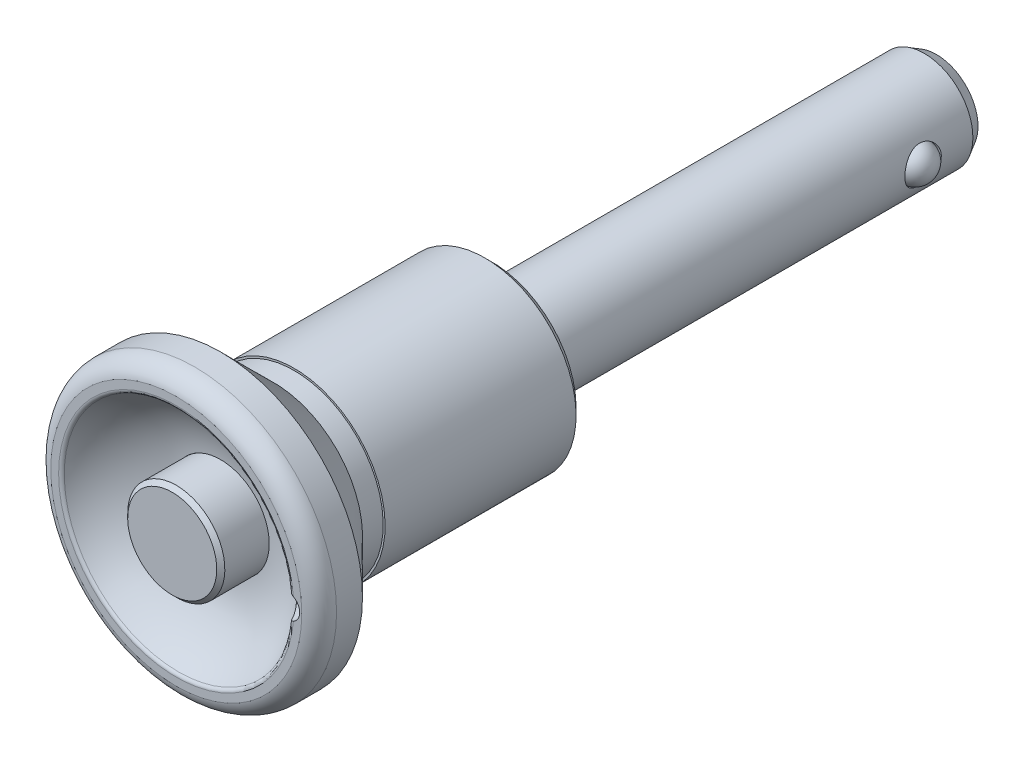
ISO-10303-21;
HEADER;
FILE_DESCRIPTION(('STEP AP214'),'2;1');
FILE_NAME('part.step','',(''),(''),'','','');
FILE_SCHEMA(('AUTOMOTIVE_DESIGN { 1 0 10303 214 1 1 1 1 }'));
ENDSEC;
DATA;
#1=APPLICATION_CONTEXT('core data for automotive mechanical design processes');
#2=APPLICATION_PROTOCOL_DEFINITION('international standard','automotive_design',2000,#1);
#3=PRODUCT_CONTEXT('',#1,'mechanical');
#4=PRODUCT('Part','Part','',(#3));
#5=PRODUCT_RELATED_PRODUCT_CATEGORY('part','',(#4));
#6=PRODUCT_DEFINITION_FORMATION('','',#4);
#7=PRODUCT_DEFINITION_CONTEXT('part definition',#1,'design');
#8=PRODUCT_DEFINITION('design','',#6,#7);
#9=PRODUCT_DEFINITION_SHAPE('','',#8);
#10=(LENGTH_UNIT() NAMED_UNIT(*) SI_UNIT(.MILLI.,.METRE.));
#11=(NAMED_UNIT(*) PLANE_ANGLE_UNIT() SI_UNIT($,.RADIAN.));
#12=(NAMED_UNIT(*) SI_UNIT($,.STERADIAN.) SOLID_ANGLE_UNIT());
#13=UNCERTAINTY_MEASURE_WITH_UNIT(LENGTH_MEASURE(1.E-05),#10,'distance_accuracy_value','');
#14=(GEOMETRIC_REPRESENTATION_CONTEXT(3) GLOBAL_UNCERTAINTY_ASSIGNED_CONTEXT((#13)) GLOBAL_UNIT_ASSIGNED_CONTEXT((#10,
#11,#12)) REPRESENTATION_CONTEXT('',''));
#15=CARTESIAN_POINT('',(0.,0.,0.));
#16=DIRECTION('',(0.,0.,1.));
#17=DIRECTION('',(1.,0.,0.));
#18=AXIS2_PLACEMENT_3D('',#15,#16,#17);
#19=CARTESIAN_POINT('',(0.,0.,-54.9));
#20=DIRECTION('',(0.,0.,-1.));
#21=DIRECTION('',(0.,1.,0.));
#22=AXIS2_PLACEMENT_3D('',#19,#20,#21);
#23=CYLINDRICAL_SURFACE('',#22,6.);
#24=CARTESIAN_POINT('',(-5.56214886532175,2.25,-47.25));
#25=CARTESIAN_POINT('',(-5.5621446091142,2.25000456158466,-47.1284887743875));
#26=CARTESIAN_POINT('',(-5.56617390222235,2.24012396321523,-47.0070076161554));
#27=CARTESIAN_POINT('',(-5.58174238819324,2.20104281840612,-46.7677078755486));
#28=CARTESIAN_POINT('',(-5.59328135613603,2.17184285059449,-46.6498891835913));
#29=CARTESIAN_POINT('',(-5.62238220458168,2.09534486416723,-46.4214369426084));
#30=CARTESIAN_POINT('',(-5.63992964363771,2.04809020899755,-46.3107869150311));
#31=CARTESIAN_POINT('',(-5.67904701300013,1.93697785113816,-46.0989421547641));
#32=CARTESIAN_POINT('',(-5.70061815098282,1.87311516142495,-45.9977502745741));
#33=CARTESIAN_POINT('',(-5.74655362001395,1.72719992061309,-45.802664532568));
#34=CARTESIAN_POINT('',(-5.77100012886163,1.64445571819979,-45.7093072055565));
#35=CARTESIAN_POINT('',(-5.81924625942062,1.46459375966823,-45.5374157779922));
#36=CARTESIAN_POINT('',(-5.84304574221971,1.36747294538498,-45.4588848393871));
#37=CARTESIAN_POINT('',(-5.88829310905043,1.15754198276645,-45.3162907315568));
#38=CARTESIAN_POINT('',(-5.90963341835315,1.04431042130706,-45.2528107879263));
#39=CARTESIAN_POINT('',(-5.94657011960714,0.807833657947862,-45.1460232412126));
#40=CARTESIAN_POINT('',(-5.96216850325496,0.684591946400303,-45.102708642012));
#41=CARTESIAN_POINT('',(-5.98528045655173,0.437234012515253,-45.0393631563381));
#42=CARTESIAN_POINT('',(-5.99311372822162,0.313384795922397,-45.0184085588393));
#43=CARTESIAN_POINT('',(-6.0009602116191,0.0636965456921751,-44.9974181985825));
#44=CARTESIAN_POINT('',(-6.00097596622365,-0.0621418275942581,-44.997375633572));
#45=CARTESIAN_POINT('',(-5.9933889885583,-0.305615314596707,-45.0176726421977));
#46=CARTESIAN_POINT('',(-5.9861631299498,-0.423348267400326,-45.0370039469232));
#47=CARTESIAN_POINT('',(-5.96539912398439,-0.653758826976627,-45.0938038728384));
#48=CARTESIAN_POINT('',(-5.95186052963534,-0.76643607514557,-45.1312737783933));
#49=CARTESIAN_POINT('',(-5.91956653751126,-0.985483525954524,-45.2237556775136));
#50=CARTESIAN_POINT('',(-5.90073809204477,-1.09173808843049,-45.2790150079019));
#51=CARTESIAN_POINT('',(-5.85976965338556,-1.29372991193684,-45.4052881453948));
#52=CARTESIAN_POINT('',(-5.83762859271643,-1.3894637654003,-45.4763070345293));
#53=CARTESIAN_POINT('',(-5.79078794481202,-1.57363573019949,-45.6369409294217));
#54=CARTESIAN_POINT('',(-5.76601445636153,-1.66131921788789,-45.727400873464));
#55=CARTESIAN_POINT('',(-5.71773690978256,-1.82055593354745,-45.921889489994));
#56=CARTESIAN_POINT('',(-5.69423317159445,-1.89210511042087,-46.0259215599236));
#57=CARTESIAN_POINT('',(-5.65069055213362,-2.01848417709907,-46.247579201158));
#58=CARTESIAN_POINT('',(-5.63074015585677,-2.07290771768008,-46.3654552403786));
#59=CARTESIAN_POINT('',(-5.59758657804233,-2.16084696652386,-46.6096443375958));
#60=CARTESIAN_POINT('',(-5.58437964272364,-2.19437430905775,-46.7359526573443));
#61=CARTESIAN_POINT('',(-5.56709395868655,-2.23785287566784,-46.9859639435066));
#62=CARTESIAN_POINT('',(-5.56255177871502,-2.24900281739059,-47.109426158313));
#63=CARTESIAN_POINT('',(-5.56179809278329,-2.25086828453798,-47.3565140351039));
#64=CARTESIAN_POINT('',(-5.56558450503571,-2.24158891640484,-47.4801396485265));
#65=CARTESIAN_POINT('',(-5.58059072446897,-2.20394600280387,-47.7178948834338));
#66=CARTESIAN_POINT('',(-5.59144914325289,-2.17650927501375,-47.8321967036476));
#67=CARTESIAN_POINT('',(-5.61894730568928,-2.10449661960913,-48.0545219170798));
#68=CARTESIAN_POINT('',(-5.63558823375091,-2.05991718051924,-48.1625440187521));
#69=CARTESIAN_POINT('',(-5.67354364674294,-1.95300438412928,-48.3737466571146));
#70=CARTESIAN_POINT('',(-5.69500993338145,-1.8900681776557,-48.4765939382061));
#71=CARTESIAN_POINT('',(-5.73994221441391,-1.74886976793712,-48.6706934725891));
#72=CARTESIAN_POINT('',(-5.76340893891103,-1.67060195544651,-48.761941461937));
#73=CARTESIAN_POINT('',(-5.81149569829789,-1.49509101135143,-48.9362525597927));
#74=CARTESIAN_POINT('',(-5.83609454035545,-1.39695951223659,-49.0184301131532));
#75=CARTESIAN_POINT('',(-5.8822481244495,-1.18769620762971,-49.1652575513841));
#76=CARTESIAN_POINT('',(-5.90380285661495,-1.076564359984,-49.2299073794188));
#77=CARTESIAN_POINT('',(-5.94142478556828,-0.844524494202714,-49.3394190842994));
#78=CARTESIAN_POINT('',(-5.95751072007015,-0.72365164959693,-49.3843486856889));
#79=CARTESIAN_POINT('',(-5.98244155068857,-0.475322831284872,-49.4529846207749));
#80=CARTESIAN_POINT('',(-5.99128984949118,-0.347869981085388,-49.4767009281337));
#81=CARTESIAN_POINT('',(-6.0004261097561,-0.09800337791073,-49.5011616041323));
#82=CARTESIAN_POINT('',(-6.00118291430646,0.0242711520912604,-49.5031642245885));
#83=CARTESIAN_POINT('',(-5.99527334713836,0.267340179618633,-49.4873772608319));
#84=CARTESIAN_POINT('',(-5.98860787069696,0.388134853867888,-49.4695900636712));
#85=CARTESIAN_POINT('',(-5.96881634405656,0.621822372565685,-49.4156117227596));
#86=CARTESIAN_POINT('',(-5.95585187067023,0.734836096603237,-49.3798801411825));
#87=CARTESIAN_POINT('',(-5.92481675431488,0.953273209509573,-49.2914849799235));
#88=CARTESIAN_POINT('',(-5.90674514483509,1.05869515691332,-49.2388181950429));
#89=CARTESIAN_POINT('',(-5.86635927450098,1.26381026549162,-49.1155290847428));
#90=CARTESIAN_POINT('',(-5.84389860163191,1.36307632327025,-49.0442450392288));
#91=CARTESIAN_POINT('',(-5.79749261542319,1.54862602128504,-48.8867882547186));
#92=CARTESIAN_POINT('',(-5.77354677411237,1.63490500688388,-48.8006102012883));
#93=CARTESIAN_POINT('',(-5.72532194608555,1.7967182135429,-48.6104038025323));
#94=CARTESIAN_POINT('',(-5.70109208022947,1.87144499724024,-48.5056733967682));
#95=CARTESIAN_POINT('',(-5.65647487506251,2.00227064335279,-48.2843761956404));
#96=CARTESIAN_POINT('',(-5.6360879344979,2.05836757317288,-48.1678081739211));
#97=CARTESIAN_POINT('',(-5.60103404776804,2.15198830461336,-47.9205664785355));
#98=CARTESIAN_POINT('',(-5.58665704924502,2.18859004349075,-47.7894984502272));
#99=CARTESIAN_POINT('',(-5.56721991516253,2.23758535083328,-47.5222720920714));
#100=CARTESIAN_POINT('',(-5.56215363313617,2.24999489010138,-47.3861171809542));
#101=CARTESIAN_POINT('',(-5.56214886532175,2.25,-47.25));
#102=B_SPLINE_CURVE_WITH_KNOTS('',3,(#24,#25,#26,#27,#28,#29,#30,#31,#32,#33,#34,#35,#36,#37,
#38,#39,#40,#41,#42,#43,#44,#45,#46,#47,#48,#49,#50,#51,#52,#53,#54,#55,#56,#57,#58,#59,#60,#61,
#62,#63,#64,#65,#66,#67,#68,#69,#70,#71,#72,#73,#74,#75,#76,#77,#78,#79,#80,#81,#82,#83,#84,#85,
#86,#87,#88,#89,#90,#91,#92,#93,#94,#95,#96,#97,#98,#99,#100,#101),.UNSPECIFIED.,.T.,.F.,(4,2,2,
2,2,2,2,2,2,2,2,2,2,2,2,2,2,2,2,2,2,2,2,2,2,2,2,2,2,2,2,2,2,2,2,2,2,2,4),(0.,0.364026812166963,
0.728042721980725,1.091189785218,1.45444601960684,1.83411978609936,2.2138744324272,
2.60655108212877,2.99909139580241,3.37470027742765,3.75018698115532,4.10709709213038,
4.46403247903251,4.82616196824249,5.18840840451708,5.57185012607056,5.95538801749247,
6.34743888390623,6.73927127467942,7.10948486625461,7.47960593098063,7.83215768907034,
8.18478170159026,8.55062341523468,8.91659922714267,9.30577525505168,9.69495254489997,
10.0827826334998,10.4704302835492,10.8354858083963,11.2004973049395,11.5566041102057,
11.9127783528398,12.2839248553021,12.6552040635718,13.0460789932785,13.436994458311,
13.8450476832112,14.2528314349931),.UNSPECIFIED.);
#103=CARTESIAN_POINT('',(-5.56214886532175,2.25,-47.25));
#104=VERTEX_POINT('',#103);
#105=EDGE_CURVE('E68',#104,#104,#102,.T.);
#106=ORIENTED_EDGE('',*,*,#105,.T.);
#107=EDGE_LOOP('',(#106));
#108=FACE_BOUND('',#107,.T.);
#109=CARTESIAN_POINT('',(0.,0.,-53.4));
#110=DIRECTION('',(0.,0.,-1.));
#111=DIRECTION('',(0.,1.,0.));
#112=AXIS2_PLACEMENT_3D('',#109,#110,#111);
#113=CIRCLE('',#112,6.);
#114=CARTESIAN_POINT('',(0.,6.,-53.4));
#115=VERTEX_POINT('',#114);
#116=EDGE_CURVE('E314',#115,#115,#113,.T.);
#117=ORIENTED_EDGE('',*,*,#116,.F.);
#118=EDGE_LOOP('',(#117));
#119=FACE_BOUND('',#118,.T.);
#120=CARTESIAN_POINT('',(5.56214886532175,2.25,-47.25));
#121=CARTESIAN_POINT('',(5.5621446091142,2.25000456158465,-47.3715112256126));
#122=CARTESIAN_POINT('',(5.56617390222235,2.24012396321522,-47.4929923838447));
#123=CARTESIAN_POINT('',(5.58174238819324,2.20104281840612,-47.7322921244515));
#124=CARTESIAN_POINT('',(5.59328135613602,2.1718428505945,-47.8501108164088));
#125=CARTESIAN_POINT('',(5.62238220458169,2.09534486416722,-48.0785630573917));
#126=CARTESIAN_POINT('',(5.63992964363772,2.04809020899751,-48.189213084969));
#127=CARTESIAN_POINT('',(5.67904701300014,1.93697785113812,-48.401057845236));
#128=CARTESIAN_POINT('',(5.70061815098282,1.87311516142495,-48.502249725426));
#129=CARTESIAN_POINT('',(5.74655362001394,1.72719992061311,-48.6973354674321));
#130=CARTESIAN_POINT('',(5.77100012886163,1.64445571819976,-48.7906927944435));
#131=CARTESIAN_POINT('',(5.81924625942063,1.46459375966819,-48.9625842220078));
#132=CARTESIAN_POINT('',(5.84304574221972,1.36747294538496,-49.0411151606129));
#133=CARTESIAN_POINT('',(5.88829310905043,1.15754198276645,-49.1837092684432));
#134=CARTESIAN_POINT('',(5.90963341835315,1.04431042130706,-49.2471892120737));
#135=CARTESIAN_POINT('',(5.94657011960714,0.80783365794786,-49.3539767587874));
#136=CARTESIAN_POINT('',(5.96216850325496,0.684591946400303,-49.397291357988));
#137=CARTESIAN_POINT('',(5.98528045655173,0.437234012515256,-49.4606368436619));
#138=CARTESIAN_POINT('',(5.99311372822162,0.313384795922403,-49.4815914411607));
#139=CARTESIAN_POINT('',(6.0009602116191,0.0636965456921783,-49.5025818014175));
#140=CARTESIAN_POINT('',(6.00097596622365,-0.0621418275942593,-49.5026243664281));
#141=CARTESIAN_POINT('',(5.9933889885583,-0.305615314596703,-49.4823273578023));
#142=CARTESIAN_POINT('',(5.9861631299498,-0.42334826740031,-49.4629960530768));
#143=CARTESIAN_POINT('',(5.96539912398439,-0.653758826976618,-49.4061961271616));
#144=CARTESIAN_POINT('',(5.95186052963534,-0.766436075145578,-49.3687262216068));
#145=CARTESIAN_POINT('',(5.91956653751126,-0.985483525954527,-49.2762443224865));
#146=CARTESIAN_POINT('',(5.90073809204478,-1.09173808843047,-49.2209849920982));
#147=CARTESIAN_POINT('',(5.85976965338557,-1.29372991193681,-49.0947118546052));
#148=CARTESIAN_POINT('',(5.83762859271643,-1.38946376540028,-49.0236929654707));
#149=CARTESIAN_POINT('',(5.79078794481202,-1.5736357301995,-48.8630590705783));
#150=CARTESIAN_POINT('',(5.76601445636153,-1.6613192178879,-48.772599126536));
#151=CARTESIAN_POINT('',(5.71773690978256,-1.82055593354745,-48.578110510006));
#152=CARTESIAN_POINT('',(5.69423317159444,-1.89210511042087,-48.4740784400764));
#153=CARTESIAN_POINT('',(5.65069055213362,-2.01848417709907,-48.252420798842));
#154=CARTESIAN_POINT('',(5.63074015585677,-2.07290771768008,-48.1345447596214));
#155=CARTESIAN_POINT('',(5.59758657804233,-2.16084696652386,-47.8903556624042));
#156=CARTESIAN_POINT('',(5.58437964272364,-2.19437430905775,-47.7640473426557));
#157=CARTESIAN_POINT('',(5.56709395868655,-2.23785287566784,-47.5140360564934));
#158=CARTESIAN_POINT('',(5.56255177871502,-2.24900281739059,-47.3905738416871));
#159=CARTESIAN_POINT('',(5.56179809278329,-2.25086828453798,-47.1434859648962));
#160=CARTESIAN_POINT('',(5.56558450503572,-2.24158891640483,-47.0198603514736));
#161=CARTESIAN_POINT('',(5.58059072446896,-2.20394600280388,-46.7821051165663));
#162=CARTESIAN_POINT('',(5.59144914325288,-2.17650927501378,-46.6678032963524));
#163=CARTESIAN_POINT('',(5.61894730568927,-2.10449661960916,-46.4454780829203));
#164=CARTESIAN_POINT('',(5.63558823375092,-2.05991718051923,-46.337455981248));
#165=CARTESIAN_POINT('',(5.67354364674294,-1.95300438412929,-46.1262533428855));
#166=CARTESIAN_POINT('',(5.69500993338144,-1.89006817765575,-46.023406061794));
#167=CARTESIAN_POINT('',(5.73994221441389,-1.74886976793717,-45.829306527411));
#168=CARTESIAN_POINT('',(5.76340893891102,-1.67060195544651,-45.7380585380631));
#169=CARTESIAN_POINT('',(5.8114956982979,-1.49509101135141,-45.5637474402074));
#170=CARTESIAN_POINT('',(5.83609454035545,-1.3969595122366,-45.4815698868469));
#171=CARTESIAN_POINT('',(5.88224812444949,-1.18769620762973,-45.3347424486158));
#172=CARTESIAN_POINT('',(5.90380285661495,-1.07656435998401,-45.2700926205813));
#173=CARTESIAN_POINT('',(5.94142478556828,-0.844524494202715,-45.1605809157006));
#174=CARTESIAN_POINT('',(5.95751072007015,-0.723651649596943,-45.1156513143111));
#175=CARTESIAN_POINT('',(5.98244155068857,-0.475322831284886,-45.0470153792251));
#176=CARTESIAN_POINT('',(5.99128984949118,-0.347869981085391,-45.0232990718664));
#177=CARTESIAN_POINT('',(6.0004261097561,-0.0980033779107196,-44.9988383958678));
#178=CARTESIAN_POINT('',(6.00118291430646,0.0242711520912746,-44.9968357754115));
#179=CARTESIAN_POINT('',(5.99527334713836,0.267340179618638,-45.0126227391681));
#180=CARTESIAN_POINT('',(5.98860787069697,0.38813485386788,-45.0304099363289));
#181=CARTESIAN_POINT('',(5.96881634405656,0.621822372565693,-45.0843882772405));
#182=CARTESIAN_POINT('',(5.95585187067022,0.734836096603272,-45.1201198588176));
#183=CARTESIAN_POINT('',(5.92481675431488,0.953273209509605,-45.2085150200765));
#184=CARTESIAN_POINT('',(5.90674514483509,1.05869515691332,-45.2611818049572));
#185=CARTESIAN_POINT('',(5.86635927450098,1.26381026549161,-45.3844709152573));
#186=CARTESIAN_POINT('',(5.8438986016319,1.36307632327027,-45.4557549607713));
#187=CARTESIAN_POINT('',(5.79749261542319,1.54862602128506,-45.6132117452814));
#188=CARTESIAN_POINT('',(5.77354677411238,1.63490500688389,-45.6993897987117));
#189=CARTESIAN_POINT('',(5.72532194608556,1.7967182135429,-45.8895961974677));
#190=CARTESIAN_POINT('',(5.70109208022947,1.87144499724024,-45.9943266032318));
#191=CARTESIAN_POINT('',(5.6564748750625,2.00227064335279,-46.2156238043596));
#192=CARTESIAN_POINT('',(5.63608793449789,2.05836757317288,-46.3321918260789));
#193=CARTESIAN_POINT('',(5.60103404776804,2.15198830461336,-46.5794335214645));
#194=CARTESIAN_POINT('',(5.58665704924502,2.18859004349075,-46.7105015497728));
#195=CARTESIAN_POINT('',(5.56721991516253,2.23758535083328,-46.9777279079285));
#196=CARTESIAN_POINT('',(5.56215363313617,2.24999489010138,-47.1138828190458));
#197=CARTESIAN_POINT('',(5.56214886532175,2.25,-47.25));
#198=B_SPLINE_CURVE_WITH_KNOTS('',3,(#120,#121,#122,#123,#124,#125,#126,#127,#128,#129,#130,
#131,#132,#133,#134,#135,#136,#137,#138,#139,#140,#141,#142,#143,#144,#145,#146,#147,#148,#149,
#150,#151,#152,#153,#154,#155,#156,#157,#158,#159,#160,#161,#162,#163,#164,#165,#166,#167,#168,
#169,#170,#171,#172,#173,#174,#175,#176,#177,#178,#179,#180,#181,#182,#183,#184,#185,#186,#187,
#188,#189,#190,#191,#192,#193,#194,#195,#196,#197),.UNSPECIFIED.,.T.,.F.,(4,2,2,2,2,2,2,2,2,2,2,
2,2,2,2,2,2,2,2,2,2,2,2,2,2,2,2,2,2,2,2,2,2,2,2,2,2,2,4),(0.,0.364026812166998,
0.728042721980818,1.09118978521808,1.45444601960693,1.83411978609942,2.21387443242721,
2.6065510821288,2.99909139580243,3.37470027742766,3.75018698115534,4.10709709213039,
4.4640324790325,4.82616196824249,5.18840840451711,5.5718501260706,5.9553880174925,
6.34743888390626,6.73927127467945,7.10948486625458,7.47960593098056,7.83215768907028,
8.1847817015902,8.55062341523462,8.91659922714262,9.30577525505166,9.69495254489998,
10.0827826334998,10.4704302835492,10.8354858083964,11.2004973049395,11.5566041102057,
11.9127783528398,12.2839248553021,12.6552040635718,13.0460789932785,13.4369944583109,
13.8450476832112,14.2528314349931),.UNSPECIFIED.);
#199=CARTESIAN_POINT('',(5.56214886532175,2.25,-47.25));
#200=VERTEX_POINT('',#199);
#201=EDGE_CURVE('E292',#200,#200,#198,.T.);
#202=ORIENTED_EDGE('',*,*,#201,.T.);
#203=EDGE_LOOP('',(#202));
#204=FACE_BOUND('',#203,.T.);
#205=CARTESIAN_POINT('',(0.,0.,0.));
#206=DIRECTION('',(0.,0.,1.));
#207=DIRECTION('',(1.,0.,0.));
#208=AXIS2_PLACEMENT_3D('',#205,#206,#207);
#209=CIRCLE('',#208,6.);
#210=CARTESIAN_POINT('',(6.,0.,0.));
#211=VERTEX_POINT('',#210);
#212=EDGE_CURVE('E80',#211,#211,#209,.T.);
#213=ORIENTED_EDGE('',*,*,#212,.F.);
#214=EDGE_LOOP('',(#213));
#215=FACE_BOUND('',#214,.T.);
#216=ADVANCED_FACE('F14',(#108,#119,#204,#215),#23,.T.);
#217=CARTESIAN_POINT('',(0.,0.,-54.9));
#218=DIRECTION('',(0.,0.,-1.));
#219=DIRECTION('',(0.,1.,0.));
#220=AXIS2_PLACEMENT_3D('',#217,#218,#219);
#221=CYLINDRICAL_SURFACE('',#220,2.75);
#222=CARTESIAN_POINT('',(0.,0.,-49.5));
#223=DIRECTION('',(0.,0.,-1.));
#224=DIRECTION('',(0.,1.,0.));
#225=AXIS2_PLACEMENT_3D('',#222,#223,#224);
#226=CIRCLE('',#225,2.75);
#227=CARTESIAN_POINT('',(0.,2.75,-49.5));
#228=VERTEX_POINT('',#227);
#229=EDGE_CURVE('E74',#228,#228,#226,.T.);
#230=ORIENTED_EDGE('',*,*,#229,.F.);
#231=EDGE_LOOP('',(#230));
#232=FACE_BOUND('',#231,.T.);
#233=CARTESIAN_POINT('',(0.,0.,-54.9));
#234=DIRECTION('',(0.,0.,-1.));
#235=DIRECTION('',(0.,1.,0.));
#236=AXIS2_PLACEMENT_3D('',#233,#234,#235);
#237=CIRCLE('',#236,2.75);
#238=CARTESIAN_POINT('',(0.,2.75,-54.9));
#239=VERTEX_POINT('',#238);
#240=EDGE_CURVE('E306',#239,#239,#237,.T.);
#241=ORIENTED_EDGE('',*,*,#240,.T.);
#242=EDGE_LOOP('',(#241));
#243=FACE_BOUND('',#242,.T.);
#244=ADVANCED_FACE('F273',(#232,#243),#221,.F.);
#245=CARTESIAN_POINT('',(2.75,0.,-54.9));
#246=DIRECTION('',(0.,0.,-1.));
#247=DIRECTION('',(0.,1.,0.));
#248=AXIS2_PLACEMENT_3D('',#245,#246,#247);
#249=PLANE('',#248);
#250=CARTESIAN_POINT('',(0.,0.,-54.9));
#251=DIRECTION('',(0.,0.,-1.));
#252=DIRECTION('',(0.,1.,0.));
#253=AXIS2_PLACEMENT_3D('',#250,#251,#252);
#254=CIRCLE('',#253,5.13397459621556);
#255=CARTESIAN_POINT('',(0.,5.13397459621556,-54.9));
#256=VERTEX_POINT('',#255);
#257=EDGE_CURVE('E310',#256,#256,#254,.T.);
#258=ORIENTED_EDGE('',*,*,#257,.T.);
#259=EDGE_LOOP('',(#258));
#260=FACE_BOUND('',#259,.T.);
#261=ORIENTED_EDGE('',*,*,#240,.F.);
#262=EDGE_LOOP('',(#261));
#263=FACE_BOUND('',#262,.T.);
#264=ADVANCED_FACE('F280',(#260,#263),#249,.T.);
#265=CARTESIAN_POINT('',(0.,0.,-54.9));
#266=DIRECTION('',(0.,0.,1.));
#267=DIRECTION('',(0.,-1.,0.));
#268=AXIS2_PLACEMENT_3D('',#265,#266,#267);
#269=CONICAL_SURFACE('',#268,5.13397459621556,0.523598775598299);
#270=ORIENTED_EDGE('',*,*,#116,.T.);
#271=EDGE_LOOP('',(#270));
#272=FACE_BOUND('',#271,.T.);
#273=ORIENTED_EDGE('',*,*,#257,.F.);
#274=EDGE_LOOP('',(#273));
#275=FACE_BOUND('',#274,.T.);
#276=ADVANCED_FACE('F288',(#272,#275),#269,.T.);
#277=CARTESIAN_POINT('',(7.,0.,-47.25));
#278=DIRECTION('',(1.,0.,0.));
#279=DIRECTION('',(0.,1.,0.));
#280=AXIS2_PLACEMENT_3D('',#277,#278,#279);
#281=CYLINDRICAL_SURFACE('',#280,2.25);
#282=CARTESIAN_POINT('',(4.70120856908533,2.25,-47.25));
#283=CARTESIAN_POINT('',(4.70121469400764,2.24999417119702,-47.1304590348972));
#284=CARTESIAN_POINT('',(4.70583400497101,2.2404126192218,-47.0107125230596));
#285=CARTESIAN_POINT('',(4.72369711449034,2.20249080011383,-46.774718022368));
#286=CARTESIAN_POINT('',(4.73696351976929,2.17410135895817,-46.6584800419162));
#287=CARTESIAN_POINT('',(4.77031963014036,2.09989154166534,-46.4333349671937));
#288=CARTESIAN_POINT('',(4.79038009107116,2.05414577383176,-46.324398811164));
#289=CARTESIAN_POINT('',(4.83501981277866,1.94674472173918,-46.1157771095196));
#290=CARTESIAN_POINT('',(4.85959823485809,1.88509238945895,-46.016089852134));
#291=CARTESIAN_POINT('',(4.91234222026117,1.74321937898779,-45.8220680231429));
#292=CARTESIAN_POINT('',(4.94063496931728,1.66209866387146,-45.7284258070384));
#293=CARTESIAN_POINT('',(4.99657815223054,1.485478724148,-45.5555585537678));
#294=CARTESIAN_POINT('',(5.02422832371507,1.38997374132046,-45.4763393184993));
#295=CARTESIAN_POINT('',(5.07733633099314,1.18176930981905,-45.3309420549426));
#296=CARTESIAN_POINT('',(5.10262925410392,1.06847133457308,-45.2655553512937));
#297=CARTESIAN_POINT('',(5.14660113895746,0.831192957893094,-45.1550726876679));
#298=CARTESIAN_POINT('',(5.16528324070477,0.707217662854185,-45.1099670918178));
#299=CARTESIAN_POINT('',(5.1930243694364,0.459385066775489,-45.0438746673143));
#300=CARTESIAN_POINT('',(5.20255899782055,0.33590140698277,-45.0216905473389));
#301=CARTESIAN_POINT('',(5.21266651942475,0.0866213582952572,-44.9981895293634));
#302=CARTESIAN_POINT('',(5.21324333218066,-0.0391739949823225,-44.9968635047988));
#303=CARTESIAN_POINT('',(5.20564133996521,-0.280752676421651,-45.0145162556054));
#304=CARTESIAN_POINT('',(5.19803132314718,-0.396653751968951,-45.0321759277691));
#305=CARTESIAN_POINT('',(5.17570524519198,-0.623658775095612,-45.0850210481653));
#306=CARTESIAN_POINT('',(5.16098865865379,-0.734762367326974,-45.1202077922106));
#307=CARTESIAN_POINT('',(5.12557562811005,-0.951074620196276,-45.2075078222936));
#308=CARTESIAN_POINT('',(5.10479112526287,-1.05616705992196,-45.2598718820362));
#309=CARTESIAN_POINT('',(5.05924909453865,-1.25634985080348,-45.3797828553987));
#310=CARTESIAN_POINT('',(5.03449013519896,-1.35143657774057,-45.4473352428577));
#311=CARTESIAN_POINT('',(4.9812692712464,-1.53647964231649,-45.6015757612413));
#312=CARTESIAN_POINT('',(4.95266891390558,-1.62551877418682,-45.689317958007));
#313=CARTESIAN_POINT('',(4.89634671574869,-1.78803350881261,-45.8785052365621));
#314=CARTESIAN_POINT('',(4.8686252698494,-1.86150219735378,-45.9799563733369));
#315=CARTESIAN_POINT('',(4.81616806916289,-1.99339518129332,-46.1984520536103));
#316=CARTESIAN_POINT('',(4.79158303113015,-2.05115292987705,-46.3159383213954));
#317=CARTESIAN_POINT('',(4.75001097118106,-2.1456830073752,-46.5603104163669));
#318=CARTESIAN_POINT('',(4.73301805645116,-2.18247161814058,-46.6871888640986));
#319=CARTESIAN_POINT('',(4.7100473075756,-2.2315930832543,-46.9375319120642));
#320=CARTESIAN_POINT('',(4.70339790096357,-2.24542132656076,-47.0606401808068));
#321=CARTESIAN_POINT('',(4.69994279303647,-2.25264846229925,-47.3075714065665));
#322=CARTESIAN_POINT('',(4.70313324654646,-2.24605533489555,-47.431394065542));
#323=CARTESIAN_POINT('',(4.71830050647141,-2.21399394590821,-47.6669653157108));
#324=CARTESIAN_POINT('',(4.72963794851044,-2.18989787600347,-47.778947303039));
#325=CARTESIAN_POINT('',(4.75898261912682,-2.12536894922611,-47.9971687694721));
#326=CARTESIAN_POINT('',(4.77699148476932,-2.08493208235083,-48.1034068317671));
#327=CARTESIAN_POINT('',(4.81860535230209,-1.98691927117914,-48.3123309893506));
#328=CARTESIAN_POINT('',(4.84242072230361,-1.92867086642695,-48.414658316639));
#329=CARTESIAN_POINT('',(4.89268495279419,-1.79734114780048,-48.6086003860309));
#330=CARTESIAN_POINT('',(4.91913500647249,-1.72425309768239,-48.7002102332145));
#331=CARTESIAN_POINT('',(4.97451487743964,-1.5576964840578,-48.8785741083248));
#332=CARTESIAN_POINT('',(5.00345675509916,-1.46299589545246,-48.9641786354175));
#333=CARTESIAN_POINT('',(5.05840859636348,-1.25992784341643,-49.11851397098));
#334=CARTESIAN_POINT('',(5.0844182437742,-1.15155890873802,-49.1872429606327));
#335=CARTESIAN_POINT('',(5.13083610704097,-0.923055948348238,-49.3059980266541));
#336=CARTESIAN_POINT('',(5.15121223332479,-0.802859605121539,-49.3559175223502));
#337=CARTESIAN_POINT('',(5.18380508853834,-0.554662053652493,-49.4344361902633));
#338=CARTESIAN_POINT('',(5.19602706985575,-0.426665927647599,-49.4630490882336));
#339=CARTESIAN_POINT('',(5.21029045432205,-0.176736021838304,-49.4963229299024));
#340=CARTESIAN_POINT('',(5.21301888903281,-0.0550554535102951,-49.5026010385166));
#341=CARTESIAN_POINT('',(5.20993078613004,0.187600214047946,-49.495446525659));
#342=CARTESIAN_POINT('',(5.2041159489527,0.308575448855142,-49.4820178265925));
#343=CARTESIAN_POINT('',(5.18496872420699,0.541359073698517,-49.436990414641));
#344=CARTESIAN_POINT('',(5.17194743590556,0.653340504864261,-49.4061426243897));
#345=CARTESIAN_POINT('',(5.13986314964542,0.870473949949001,-49.3280030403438));
#346=CARTESIAN_POINT('',(5.12079904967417,0.975624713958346,-49.2807082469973));
#347=CARTESIAN_POINT('',(5.07736891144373,1.18141977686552,-49.1686191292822));
#348=CARTESIAN_POINT('',(5.05280038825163,1.28163851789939,-49.1031238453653));
#349=CARTESIAN_POINT('',(5.00122306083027,1.47009921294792,-48.957485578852));
#350=CARTESIAN_POINT('',(4.9742132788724,1.5583363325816,-48.877336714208));
#351=CARTESIAN_POINT('',(4.9182708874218,1.72712341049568,-48.6976966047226));
#352=CARTESIAN_POINT('',(4.88934356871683,1.80662459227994,-48.5972140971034));
#353=CARTESIAN_POINT('',(4.83482876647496,1.94782882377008,-48.3835276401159));
#354=CARTESIAN_POINT('',(4.80924325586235,2.00952138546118,-48.270316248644));
#355=CARTESIAN_POINT('',(4.76470338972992,2.11297708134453,-48.0338474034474));
#356=CARTESIAN_POINT('',(4.74574393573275,2.15475554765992,-47.9105977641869));
#357=CARTESIAN_POINT('',(4.72435108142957,2.20105394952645,-47.7212685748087));
#358=CARTESIAN_POINT('',(4.71839681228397,2.21375426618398,-47.6574783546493));
#359=CARTESIAN_POINT('',(4.70903769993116,2.23359624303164,-47.5288695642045));
#360=CARTESIAN_POINT('',(4.70563091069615,2.2407421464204,-47.4640518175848));
#361=CARTESIAN_POINT('',(4.7027842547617,2.24670526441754,-47.3742341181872));
#362=CARTESIAN_POINT('',(4.70219412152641,2.24794009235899,-47.349407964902));
#363=CARTESIAN_POINT('',(4.70140563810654,2.24958807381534,-47.2997241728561));
#364=CARTESIAN_POINT('',(4.70120729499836,2.25000121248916,-47.2748665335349));
#365=CARTESIAN_POINT('',(4.70120856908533,2.25,-47.25));
#366=B_SPLINE_CURVE_WITH_KNOTS('',3,(#282,#283,#284,#285,#286,#287,#288,#289,#290,#291,#292,
#293,#294,#295,#296,#297,#298,#299,#300,#301,#302,#303,#304,#305,#306,#307,#308,#309,#310,#311,
#312,#313,#314,#315,#316,#317,#318,#319,#320,#321,#322,#323,#324,#325,#326,#327,#328,#329,#330,
#331,#332,#333,#334,#335,#336,#337,#338,#339,#340,#341,#342,#343,#344,#345,#346,#347,#348,#349,
#350,#351,#352,#353,#354,#355,#356,#357,#358,#359,#360,#361,#362,#363,#364,#365),.UNSPECIFIED.,
.T.,.F.,(4,2,2,2,2,2,2,2,2,2,2,2,2,2,2,2,2,2,2,2,2,2,2,2,2,2,2,2,2,2,2,2,2,2,2,2,2,2,2,2,2,4),
(0.,0.358523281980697,0.717987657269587,1.07592402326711,1.43379401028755,1.81338979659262,
2.19313794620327,2.5907971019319,2.98826712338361,3.36372670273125,3.73902199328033,
4.08983186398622,4.44066767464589,4.79687203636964,5.15320497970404,5.53621810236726,
5.91940095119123,6.31693575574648,6.71416146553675,7.08432459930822,7.45434310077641,
7.79811230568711,8.14196592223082,8.50086375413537,8.85992486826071,9.25080120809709,
9.64171965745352,10.0348210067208,10.427668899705,10.7914180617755,11.1550948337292,
11.5041747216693,11.8533183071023,12.2184179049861,12.583664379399,12.9758816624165,
13.3683294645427,13.7604746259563,13.9561801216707,14.1517359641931,14.2263134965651,
14.3008923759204),.UNSPECIFIED.);
#367=CARTESIAN_POINT('',(4.84677342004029,1.91641577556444,-48.4289192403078));
#368=VERTEX_POINT('',#367);
#369=CARTESIAN_POINT('',(4.84677342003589,-1.91641577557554,-48.4289192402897));
#370=VERTEX_POINT('',#369);
#371=EDGE_CURVE('E70',#368,#370,#366,.T.);
#372=ORIENTED_EDGE('',*,*,#371,.F.);
#373=CARTESIAN_POINT('',(5.21189620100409,0.,-49.5));
#374=CARTESIAN_POINT('',(5.21189615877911,0.126284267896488,-49.4999948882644));
#375=CARTESIAN_POINT('',(5.21139467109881,0.25264400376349,-49.4893340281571));
#376=CARTESIAN_POINT('',(5.20938058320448,0.501864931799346,-49.4469613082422));
#377=CARTESIAN_POINT('',(5.20786696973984,0.624722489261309,-49.4152283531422));
#378=CARTESIAN_POINT('',(5.20380519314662,0.863320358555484,-49.3316208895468));
#379=CARTESIAN_POINT('',(5.20125743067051,0.97906340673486,-49.2797541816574));
#380=CARTESIAN_POINT('',(5.19508229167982,1.20015943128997,-49.1573752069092));
#381=CARTESIAN_POINT('',(5.19145518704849,1.30551501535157,-49.0868676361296));
#382=CARTESIAN_POINT('',(5.18303472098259,1.50291352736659,-48.9291996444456));
#383=CARTESIAN_POINT('',(5.17824107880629,1.59495324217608,-48.8420352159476));
#384=CARTESIAN_POINT('',(5.16733442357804,1.76311423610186,-48.653525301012));
#385=CARTESIAN_POINT('',(5.1612210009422,1.83923055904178,-48.5521754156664));
#386=CARTESIAN_POINT('',(5.14734400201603,1.97343552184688,-48.3381336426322));
#387=CARTESIAN_POINT('',(5.13957863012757,2.0315043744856,-48.2254294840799));
#388=CARTESIAN_POINT('',(5.12176723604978,2.1278284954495,-47.9921124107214));
#389=CARTESIAN_POINT('',(5.11172400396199,2.1661078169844,-47.8715092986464));
#390=CARTESIAN_POINT('',(5.0933054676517,2.2077406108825,-47.6884429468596));
#391=CARTESIAN_POINT('',(5.08666779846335,2.21896106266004,-47.6275162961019));
#392=CARTESIAN_POINT('',(5.07117135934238,2.23631965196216,-47.5053136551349));
#393=CARTESIAN_POINT('',(5.062314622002,2.24246241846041,-47.444038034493));
#394=CARTESIAN_POINT('',(5.04473959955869,2.24786649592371,-47.3524947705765));
#395=CARTESIAN_POINT('',(5.03817832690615,2.24903385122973,-47.3220839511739));
#396=CARTESIAN_POINT('',(5.02487846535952,2.24972982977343,-47.2856268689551));
#397=CARTESIAN_POINT('',(5.02196282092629,2.24983087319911,-47.278411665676));
#398=CARTESIAN_POINT('',(5.01679668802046,2.24992122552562,-47.2690075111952));
#399=CARTESIAN_POINT('',(5.01524668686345,2.24994100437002,-47.2664653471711));
#400=CARTESIAN_POINT('',(5.01258312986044,2.24996347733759,-47.2628773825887));
#401=CARTESIAN_POINT('',(5.01163231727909,2.24996978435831,-47.2617128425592));
#402=CARTESIAN_POINT('',(5.00957474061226,2.24998007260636,-47.2595306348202));
#403=CARTESIAN_POINT('',(5.00846878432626,2.24998406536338,-47.258512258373));
#404=CARTESIAN_POINT('',(5.0067156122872,2.2499883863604,-47.2572404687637));
#405=CARTESIAN_POINT('',(5.00615104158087,2.2499895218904,-47.2568745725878));
#406=CARTESIAN_POINT('',(5.00497729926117,2.2499914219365,-47.2562214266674));
#407=CARTESIAN_POINT('',(5.00436814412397,2.24999218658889,-47.255934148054));
#408=CARTESIAN_POINT('',(5.00310140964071,2.24999338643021,-47.2554607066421));
#409=CARTESIAN_POINT('',(5.00244330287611,2.24999381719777,-47.2552759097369));
#410=CARTESIAN_POINT('',(5.0011038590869,2.24999436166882,-47.2550386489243));
#411=CARTESIAN_POINT('',(5.00042256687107,2.24999447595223,-47.2549859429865));
#412=CARTESIAN_POINT('',(4.99914424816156,2.24999440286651,-47.2550185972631));
#413=CARTESIAN_POINT('',(4.99854676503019,2.24999424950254,-47.2550883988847));
#414=CARTESIAN_POINT('',(4.99737209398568,2.24999369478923,-47.2553279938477));
#415=CARTESIAN_POINT('',(4.99679493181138,2.24999329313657,-47.2554979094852));
#416=CARTESIAN_POINT('',(4.99546550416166,2.24999202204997,-47.255998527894));
#417=CARTESIAN_POINT('',(4.99472705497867,2.24999103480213,-47.256365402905));
#418=CARTESIAN_POINT('',(4.99331619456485,2.24998849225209,-47.2572086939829));
#419=CARTESIAN_POINT('',(4.99264394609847,2.24998693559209,-47.257685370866));
#420=CARTESIAN_POINT('',(4.9907978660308,2.24998155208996,-47.2591607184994));
#421=CARTESIAN_POINT('',(4.98969889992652,2.24997693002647,-47.2602516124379));
#422=CARTESIAN_POINT('',(4.98765562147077,2.24996520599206,-47.2625688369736));
#423=CARTESIAN_POINT('',(4.98671188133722,2.249958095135,-47.2637956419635));
#424=CARTESIAN_POINT('',(4.98193653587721,2.2499128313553,-47.2705312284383));
#425=CARTESIAN_POINT('',(4.97899990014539,2.2498503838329,-47.2766418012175));
#426=CARTESIAN_POINT('',(4.97376920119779,2.24966896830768,-47.2891278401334));
#427=CARTESIAN_POINT('',(4.97148201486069,2.24954942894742,-47.2955053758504));
#428=CARTESIAN_POINT('',(4.96106149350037,2.24881762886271,-47.327105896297));
#429=CARTESIAN_POINT('',(4.95530816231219,2.24778447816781,-47.3531043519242));
#430=CARTESIAN_POINT('',(4.94501184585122,2.24479018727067,-47.4053004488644));
#431=CARTESIAN_POINT('',(4.94047527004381,2.24282427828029,-47.4314984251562));
#432=CARTESIAN_POINT('',(4.92798476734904,2.23550007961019,-47.5104298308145));
#433=CARTESIAN_POINT('',(4.92120435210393,2.22872063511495,-47.5632520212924));
#434=CARTESIAN_POINT('',(4.9089113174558,2.21142389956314,-47.6682645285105));
#435=CARTESIAN_POINT('',(4.90339617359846,2.20091415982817,-47.7204559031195));
#436=CARTESIAN_POINT('',(4.88803764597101,2.16373012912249,-47.8762327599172));
#437=CARTESIAN_POINT('',(4.87942579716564,2.13143364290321,-47.9786677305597));
#438=CARTESIAN_POINT('',(4.86395279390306,2.05263870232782,-48.1776953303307));
#439=CARTESIAN_POINT('',(4.85708717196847,2.00617717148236,-48.2743023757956));
#440=CARTESIAN_POINT('',(4.84463430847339,1.89998698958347,-48.4599495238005));
#441=CARTESIAN_POINT('',(4.83904642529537,1.84026502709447,-48.5489934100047));
#442=CARTESIAN_POINT('',(4.82796886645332,1.69683921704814,-48.7329593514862));
#443=CARTESIAN_POINT('',(4.82267830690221,1.61075316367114,-48.8260495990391));
#444=CARTESIAN_POINT('',(4.81331124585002,1.42411005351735,-48.9965405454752));
#445=CARTESIAN_POINT('',(4.80923548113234,1.32354426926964,-49.0739317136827));
#446=CARTESIAN_POINT('',(4.80219403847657,1.11084101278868,-49.2107437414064));
#447=CARTESIAN_POINT('',(4.79922814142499,0.998705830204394,-49.270168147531));
#448=CARTESIAN_POINT('',(4.79434733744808,0.766047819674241,-49.3693541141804));
#449=CARTESIAN_POINT('',(4.7924323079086,0.645525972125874,-49.4091179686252));
#450=CARTESIAN_POINT('',(4.78962227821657,0.399571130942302,-49.4678412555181));
#451=CARTESIAN_POINT('',(4.78872674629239,0.274140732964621,-49.4868115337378));
#452=CARTESIAN_POINT('',(4.78794106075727,0.021870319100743,-49.5034420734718));
#453=CARTESIAN_POINT('',(4.78805091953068,-0.104969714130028,-49.5011020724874));
#454=CARTESIAN_POINT('',(4.78927737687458,-0.356418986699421,-49.4751821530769));
#455=CARTESIAN_POINT('',(4.79039368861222,-0.481028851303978,-49.4516082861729));
#456=CARTESIAN_POINT('',(4.79364906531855,-0.724519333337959,-49.3839024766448));
#457=CARTESIAN_POINT('',(4.79578813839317,-0.843399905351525,-49.339770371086));
#458=CARTESIAN_POINT('',(4.80112512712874,-1.0720730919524,-49.2322025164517));
#459=CARTESIAN_POINT('',(4.80432317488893,-1.18186457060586,-49.1687643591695));
#460=CARTESIAN_POINT('',(4.81184515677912,-1.3892259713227,-49.0244041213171));
#461=CARTESIAN_POINT('',(4.81616903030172,-1.48679655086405,-48.9434829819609));
#462=CARTESIAN_POINT('',(4.82606445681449,-1.66699500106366,-48.7664389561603));
#463=CARTESIAN_POINT('',(4.8316364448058,-1.74961764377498,-48.6703107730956));
#464=CARTESIAN_POINT('',(4.84427017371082,-1.89756793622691,-48.465602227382));
#465=CARTESIAN_POINT('',(4.85133233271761,-1.96289072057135,-48.3570183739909));
#466=CARTESIAN_POINT('',(4.86742332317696,-2.07443577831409,-48.1304409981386));
#467=CARTESIAN_POINT('',(4.87645418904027,-2.12063814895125,-48.0124378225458));
#468=CARTESIAN_POINT('',(4.89787609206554,-2.19253624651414,-47.7707327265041));
#469=CARTESIAN_POINT('',(4.91026387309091,-2.2182517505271,-47.6470364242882));
#470=CARTESIAN_POINT('',(4.93489152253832,-2.24079197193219,-47.4621887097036));
#471=CARTESIAN_POINT('',(4.94392093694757,-2.24567525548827,-47.4016395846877));
#472=CARTESIAN_POINT('',(4.96144377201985,-2.24865520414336,-47.3288938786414));
#473=CARTESIAN_POINT('',(4.96488235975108,-2.24907569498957,-47.3157504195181));
#474=CARTESIAN_POINT('',(4.97117438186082,-2.24953233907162,-47.2963421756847));
#475=CARTESIAN_POINT('',(4.97347535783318,-2.24965571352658,-47.2898919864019));
#476=CARTESIAN_POINT('',(4.97872381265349,-2.2498436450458,-47.277231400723));
#477=CARTESIAN_POINT('',(4.98166680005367,-2.24990859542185,-47.2710196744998));
#478=CARTESIAN_POINT('',(4.98649447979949,-2.24995636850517,-47.264083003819));
#479=CARTESIAN_POINT('',(4.98748893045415,-2.24996411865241,-47.2627698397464));
#480=CARTESIAN_POINT('',(4.98964936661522,-2.24997676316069,-47.2602966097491));
#481=CARTESIAN_POINT('',(4.99081420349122,-2.24998167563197,-47.2591356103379));
#482=CARTESIAN_POINT('',(4.99264559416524,-2.24998690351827,-47.2576897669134));
#483=CARTESIAN_POINT('',(4.9932154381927,-2.24998824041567,-47.2572839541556));
#484=CARTESIAN_POINT('',(4.99440370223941,-2.24999050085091,-47.2565481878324));
#485=CARTESIAN_POINT('',(4.99502214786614,-2.24999142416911,-47.2562182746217));
#486=CARTESIAN_POINT('',(4.99631433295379,-2.24999290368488,-47.2556581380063));
#487=CARTESIAN_POINT('',(4.99698872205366,-2.24999345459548,-47.2554293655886));
#488=CARTESIAN_POINT('',(4.99836895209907,-2.24999420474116,-47.2551094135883));
#489=CARTESIAN_POINT('',(4.99907470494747,-2.24999440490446,-47.2550178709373));
#490=CARTESIAN_POINT('',(5.00040115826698,-2.24999446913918,-47.2549888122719));
#491=CARTESIAN_POINT('',(5.00102150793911,-2.24999437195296,-47.2550335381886));
#492=CARTESIAN_POINT('',(5.00224443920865,-2.24999391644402,-47.2552331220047));
#493=CARTESIAN_POINT('',(5.00284699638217,-2.24999355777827,-47.2553881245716));
#494=CARTESIAN_POINT('',(5.00417868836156,-2.24999242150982,-47.255845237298));
#495=CARTESIAN_POINT('',(5.0048978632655,-2.24999155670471,-47.2561758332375));
#496=CARTESIAN_POINT('',(5.00627531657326,-2.24998931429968,-47.2569451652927));
#497=CARTESIAN_POINT('',(5.0069334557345,-2.24998793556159,-47.2573841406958));
#498=CARTESIAN_POINT('',(5.0087083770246,-2.24998324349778,-47.2587256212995));
#499=CARTESIAN_POINT('',(5.00975965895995,-2.24997927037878,-47.2597134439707));
#500=CARTESIAN_POINT('',(5.01171957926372,-2.24996920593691,-47.2618205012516));
#501=CARTESIAN_POINT('',(5.01262772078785,-2.24996310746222,-47.2629401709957));
#502=CARTESIAN_POINT('',(5.01640763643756,-2.2499311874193,-47.2680200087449));
#503=CARTESIAN_POINT('',(5.01876364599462,-2.24989314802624,-47.2723506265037));
#504=CARTESIAN_POINT('',(5.02299212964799,-2.24978775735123,-47.2812382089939));
#505=CARTESIAN_POINT('',(5.02486105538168,-2.24972020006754,-47.2857965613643));
#506=CARTESIAN_POINT('',(5.03489036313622,-2.24924415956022,-47.3122210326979));
#507=CARTESIAN_POINT('',(5.0404284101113,-2.24850580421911,-47.3350346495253));
#508=CARTESIAN_POINT('',(5.05033017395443,-2.24631053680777,-47.3808965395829));
#509=CARTESIAN_POINT('',(5.05468563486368,-2.24484876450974,-47.4039453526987));
#510=CARTESIAN_POINT('',(5.06660405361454,-2.2393744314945,-47.4732312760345));
#511=CARTESIAN_POINT('',(5.07302100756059,-2.23427272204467,-47.5196160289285));
#512=CARTESIAN_POINT('',(5.08465584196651,-2.22118976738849,-47.6119328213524));
#513=CARTESIAN_POINT('',(5.08987723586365,-2.21321714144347,-47.657865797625));
#514=CARTESIAN_POINT('',(5.10441457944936,-2.1849605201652,-47.7951352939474));
#515=CARTESIAN_POINT('',(5.11257661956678,-2.16035336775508,-47.8857441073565));
#516=CARTESIAN_POINT('',(5.12987991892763,-2.0895877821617,-48.093794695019));
#517=CARTESIAN_POINT('',(5.13839608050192,-2.03893154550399,-48.2097746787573));
#518=CARTESIAN_POINT('',(5.15359757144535,-1.91883883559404,-48.4317326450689));
#519=CARTESIAN_POINT('',(5.16028217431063,-1.84939493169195,-48.5377066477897));
#520=CARTESIAN_POINT('',(5.17224042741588,-1.69367708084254,-48.7365753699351));
#521=CARTESIAN_POINT('',(5.17751400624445,-1.60740228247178,-48.8294694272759));
#522=CARTESIAN_POINT('',(5.18684741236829,-1.42044938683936,-48.9995115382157));
#523=CARTESIAN_POINT('',(5.19090710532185,-1.31976969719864,-49.0766578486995));
#524=CARTESIAN_POINT('',(5.19792144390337,-1.10680030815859,-49.2130331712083));
#525=CARTESIAN_POINT('',(5.20087527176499,-0.994502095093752,-49.2722489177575));
#526=CARTESIAN_POINT('',(5.20572992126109,-0.761612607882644,-49.3709456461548));
#527=CARTESIAN_POINT('',(5.20763177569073,-0.64102959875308,-49.4104459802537));
#528=CARTESIAN_POINT('',(5.20998371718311,-0.433255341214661,-49.4596153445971));
#529=CARTESIAN_POINT('',(5.21070118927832,-0.347316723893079,-49.4747381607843));
#530=CARTESIAN_POINT('',(5.21165744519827,-0.174264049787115,-49.4949322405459));
#531=CARTESIAN_POINT('',(5.21189623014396,-0.0871499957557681,-49.5000035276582));
#532=CARTESIAN_POINT('',(5.21189620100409,0.,-49.5));
#533=B_SPLINE_CURVE_WITH_KNOTS('',3,(#373,#374,#375,#376,#377,#378,#379,#380,#381,#382,#383,
#384,#385,#386,#387,#388,#389,#390,#391,#392,#393,#394,#395,#396,#397,#398,#399,#400,#401,#402,
#403,#404,#405,#406,#407,#408,#409,#410,#411,#412,#413,#414,#415,#416,#417,#418,#419,#420,#421,
#422,#423,#424,#425,#426,#427,#428,#429,#430,#431,#432,#433,#434,#435,#436,#437,#438,#439,#440,
#441,#442,#443,#444,#445,#446,#447,#448,#449,#450,#451,#452,#453,#454,#455,#456,#457,#458,#459,
#460,#461,#462,#463,#464,#465,#466,#467,#468,#469,#470,#471,#472,#473,#474,#475,#476,#477,#478,
#479,#480,#481,#482,#483,#484,#485,#486,#487,#488,#489,#490,#491,#492,#493,#494,#495,#496,#497,
#498,#499,#500,#501,#502,#503,#504,#505,#506,#507,#508,#509,#510,#511,#512,#513,#514,#515,#516,
#517,#518,#519,#520,#521,#522,#523,#524,#525,#526,#527,#528,#529,#530,#531,#532),.UNSPECIFIED.,
.T.,.F.,(4,2,2,2,2,2,2,2,2,2,2,2,2,2,2,2,2,2,2,2,2,2,2,2,2,2,2,2,2,2,2,2,2,2,2,2,2,2,2,2,2,2,2,
2,2,2,2,2,2,2,2,2,2,2,2,2,2,2,2,2,2,2,2,2,2,2,2,2,2,2,2,2,2,2,2,2,2,2,2,4),(0.,0.3785366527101,
0.75745283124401,1.13622234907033,1.5148965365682,1.89366194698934,2.27254507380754,
2.6518421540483,3.03067712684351,3.21736841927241,3.40388932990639,3.49689225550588,
3.52015002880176,3.52905034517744,3.53355316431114,3.53803335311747,3.54004707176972,
3.54206004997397,3.54409924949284,3.54613470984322,3.54792997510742,3.54972743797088,
3.55218703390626,3.55465253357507,3.5592719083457,3.56390794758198,3.58404523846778,
3.6043884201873,3.68399607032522,3.76401517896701,3.92481563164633,4.08529241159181,
4.40730884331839,4.72849296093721,5.04951543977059,5.42838148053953,5.80747684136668,
6.18649732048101,6.56547356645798,6.94425204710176,7.32303519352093,7.70171042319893,
8.08038865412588,8.45911414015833,8.83781924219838,9.2166565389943,9.5956002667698,
9.97493745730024,10.3539080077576,10.5376762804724,10.5783848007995,10.5989488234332,
10.6193733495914,10.624307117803,10.6292090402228,10.6313034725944,10.6333990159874,
10.6355237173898,10.6376427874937,10.6394980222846,10.6413556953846,10.6437168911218,
10.6460833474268,10.650386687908,10.6547046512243,10.6693813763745,10.6841622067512,
10.7542437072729,10.8248025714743,10.9658951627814,11.1065676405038,11.3885103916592,
11.7672030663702,12.1460457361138,12.5249075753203,12.9038113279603,13.2829947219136,
13.6618051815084,13.9230376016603,14.1842694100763),.UNSPECIFIED.);
#534=EDGE_CURVE('E32',#370,#368,#533,.T.);
#535=ORIENTED_EDGE('',*,*,#534,.F.);
#536=EDGE_LOOP('',(#372,#535));
#537=FACE_BOUND('',#536,.T.);
#538=ORIENTED_EDGE('',*,*,#201,.F.);
#539=EDGE_LOOP('',(#538));
#540=FACE_BOUND('',#539,.T.);
#541=ADVANCED_FACE('F71',(#537,#540),#281,.F.);
#542=CARTESIAN_POINT('',(-4.70120856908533,2.25,-47.25));
#543=CARTESIAN_POINT('',(-4.70121469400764,2.24999417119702,-47.3695409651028));
#544=CARTESIAN_POINT('',(-4.70583400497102,2.24041261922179,-47.4892874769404));
#545=CARTESIAN_POINT('',(-4.72369711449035,2.20249080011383,-47.7252819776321));
#546=CARTESIAN_POINT('',(-4.73696351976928,2.17410135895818,-47.8415199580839));
#547=CARTESIAN_POINT('',(-4.77031963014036,2.09989154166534,-48.0666650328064));
#548=CARTESIAN_POINT('',(-4.79038009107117,2.05414577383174,-48.1756011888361));
#549=CARTESIAN_POINT('',(-4.83501981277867,1.94674472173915,-48.3842228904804));
#550=CARTESIAN_POINT('',(-4.85959823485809,1.88509238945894,-48.483910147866));
#551=CARTESIAN_POINT('',(-4.91234222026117,1.74321937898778,-48.6779319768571));
#552=CARTESIAN_POINT('',(-4.94063496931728,1.66209866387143,-48.7715741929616));
#553=CARTESIAN_POINT('',(-4.99657815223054,1.48547872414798,-48.9444414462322));
#554=CARTESIAN_POINT('',(-5.02422832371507,1.38997374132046,-49.0236606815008));
#555=CARTESIAN_POINT('',(-5.07733633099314,1.18176930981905,-49.1690579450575));
#556=CARTESIAN_POINT('',(-5.10262925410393,1.06847133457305,-49.2344446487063));
#557=CARTESIAN_POINT('',(-5.14660113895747,0.831192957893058,-49.3449273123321));
#558=CARTESIAN_POINT('',(-5.16528324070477,0.707217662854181,-49.3900329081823));
#559=CARTESIAN_POINT('',(-5.1930243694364,0.459385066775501,-49.4561253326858));
#560=CARTESIAN_POINT('',(-5.20255899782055,0.33590140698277,-49.4783094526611));
#561=CARTESIAN_POINT('',(-5.21266651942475,0.0866213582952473,-49.5018104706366));
#562=CARTESIAN_POINT('',(-5.21324333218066,-0.0391739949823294,-49.5031364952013));
#563=CARTESIAN_POINT('',(-5.20564133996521,-0.280752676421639,-49.4854837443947));
#564=CARTESIAN_POINT('',(-5.19803132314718,-0.396653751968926,-49.4678240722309));
#565=CARTESIAN_POINT('',(-5.17570524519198,-0.623658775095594,-49.4149789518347));
#566=CARTESIAN_POINT('',(-5.16098865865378,-0.734762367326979,-49.3797922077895));
#567=CARTESIAN_POINT('',(-5.12557562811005,-0.95107462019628,-49.2924921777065));
#568=CARTESIAN_POINT('',(-5.10479112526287,-1.05616705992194,-49.2401281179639));
#569=CARTESIAN_POINT('',(-5.05924909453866,-1.25634985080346,-49.1202171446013));
#570=CARTESIAN_POINT('',(-5.03449013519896,-1.35143657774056,-49.0526647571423));
#571=CARTESIAN_POINT('',(-4.9812692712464,-1.53647964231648,-48.8984242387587));
#572=CARTESIAN_POINT('',(-4.95266891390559,-1.62551877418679,-48.810682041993));
#573=CARTESIAN_POINT('',(-4.8963467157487,-1.78803350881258,-48.621494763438));
#574=CARTESIAN_POINT('',(-4.86862526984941,-1.86150219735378,-48.5200436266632));
#575=CARTESIAN_POINT('',(-4.8161680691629,-1.99339518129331,-48.3015479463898));
#576=CARTESIAN_POINT('',(-4.79158303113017,-2.05115292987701,-48.1840616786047));
#577=CARTESIAN_POINT('',(-4.75001097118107,-2.14568300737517,-47.9396895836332));
#578=CARTESIAN_POINT('',(-4.73301805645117,-2.18247161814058,-47.8128111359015));
#579=CARTESIAN_POINT('',(-4.7100473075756,-2.23159308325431,-47.5624680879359));
#580=CARTESIAN_POINT('',(-4.70339790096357,-2.24542132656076,-47.4393598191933));
#581=CARTESIAN_POINT('',(-4.69994279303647,-2.25264846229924,-47.1924285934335));
#582=CARTESIAN_POINT('',(-4.70313324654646,-2.24605533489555,-47.0686059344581));
#583=CARTESIAN_POINT('',(-4.71830050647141,-2.21399394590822,-46.8330346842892));
#584=CARTESIAN_POINT('',(-4.72963794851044,-2.18989787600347,-46.721052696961));
#585=CARTESIAN_POINT('',(-4.75898261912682,-2.12536894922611,-46.502831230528));
#586=CARTESIAN_POINT('',(-4.77699148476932,-2.08493208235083,-46.3965931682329));
#587=CARTESIAN_POINT('',(-4.81860535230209,-1.98691927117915,-46.1876690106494));
#588=CARTESIAN_POINT('',(-4.8424207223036,-1.92867086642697,-46.085341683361));
#589=CARTESIAN_POINT('',(-4.89268495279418,-1.7973411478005,-45.8913996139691));
#590=CARTESIAN_POINT('',(-4.91913500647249,-1.72425309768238,-45.7997897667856));
#591=CARTESIAN_POINT('',(-4.97451487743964,-1.55769648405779,-45.6214258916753));
#592=CARTESIAN_POINT('',(-5.00345675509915,-1.46299589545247,-45.5358213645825));
#593=CARTESIAN_POINT('',(-5.05840859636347,-1.25992784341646,-45.38148602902));
#594=CARTESIAN_POINT('',(-5.0844182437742,-1.15155890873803,-45.3127570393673));
#595=CARTESIAN_POINT('',(-5.13083610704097,-0.923055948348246,-45.1940019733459));
#596=CARTESIAN_POINT('',(-5.15121223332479,-0.802859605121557,-45.1440824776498));
#597=CARTESIAN_POINT('',(-5.18380508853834,-0.554662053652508,-45.0655638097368));
#598=CARTESIAN_POINT('',(-5.19602706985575,-0.426665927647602,-45.0369509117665));
#599=CARTESIAN_POINT('',(-5.21029045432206,-0.176736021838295,-45.0036770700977));
#600=CARTESIAN_POINT('',(-5.21301888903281,-0.0550554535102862,-44.9973989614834));
#601=CARTESIAN_POINT('',(-5.20993078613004,0.187600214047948,-45.004553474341));
#602=CARTESIAN_POINT('',(-5.2041159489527,0.308575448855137,-45.0179821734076));
#603=CARTESIAN_POINT('',(-5.18496872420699,0.541359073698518,-45.0630095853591));
#604=CARTESIAN_POINT('',(-5.17194743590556,0.653340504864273,-45.0938573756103));
#605=CARTESIAN_POINT('',(-5.13986314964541,0.870473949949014,-45.1719969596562));
#606=CARTESIAN_POINT('',(-5.12079904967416,0.975624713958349,-45.2192917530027));
#607=CARTESIAN_POINT('',(-5.07736891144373,1.18141977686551,-45.3313808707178));
#608=CARTESIAN_POINT('',(-5.05280038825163,1.28163851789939,-45.3968761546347));
#609=CARTESIAN_POINT('',(-5.00122306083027,1.47009921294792,-45.542514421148));
#610=CARTESIAN_POINT('',(-4.9742132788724,1.55833633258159,-45.622663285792));
#611=CARTESIAN_POINT('',(-4.91827088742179,1.72712341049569,-45.8023033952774));
#612=CARTESIAN_POINT('',(-4.88934356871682,1.80662459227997,-45.9027859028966));
#613=CARTESIAN_POINT('',(-4.83482876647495,1.94782882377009,-46.1164723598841));
#614=CARTESIAN_POINT('',(-4.80924325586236,2.00952138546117,-46.2296837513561));
#615=CARTESIAN_POINT('',(-4.76470338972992,2.11297708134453,-46.4661525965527));
#616=CARTESIAN_POINT('',(-4.74574393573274,2.15475554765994,-46.5894022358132));
#617=CARTESIAN_POINT('',(-4.72435108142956,2.20105394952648,-46.7787314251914));
#618=CARTESIAN_POINT('',(-4.71839681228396,2.213754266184,-46.8425216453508));
#619=CARTESIAN_POINT('',(-4.70903769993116,2.23359624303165,-46.9711304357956));
#620=CARTESIAN_POINT('',(-4.70563091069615,2.2407421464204,-47.0359481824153));
#621=CARTESIAN_POINT('',(-4.7027842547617,2.24670526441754,-47.1257658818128));
#622=CARTESIAN_POINT('',(-4.7021941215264,2.24794009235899,-47.1505920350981));
#623=CARTESIAN_POINT('',(-4.70140563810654,2.24958807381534,-47.2002758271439));
#624=CARTESIAN_POINT('',(-4.70120729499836,2.25000121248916,-47.2251334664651));
#625=CARTESIAN_POINT('',(-4.70120856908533,2.25,-47.25));
#626=B_SPLINE_CURVE_WITH_KNOTS('',3,(#542,#543,#544,#545,#546,#547,#548,#549,#550,#551,#552,
#553,#554,#555,#556,#557,#558,#559,#560,#561,#562,#563,#564,#565,#566,#567,#568,#569,#570,#571,
#572,#573,#574,#575,#576,#577,#578,#579,#580,#581,#582,#583,#584,#585,#586,#587,#588,#589,#590,
#591,#592,#593,#594,#595,#596,#597,#598,#599,#600,#601,#602,#603,#604,#605,#606,#607,#608,#609,
#610,#611,#612,#613,#614,#615,#616,#617,#618,#619,#620,#621,#622,#623,#624,#625),.UNSPECIFIED.,
.T.,.F.,(4,2,2,2,2,2,2,2,2,2,2,2,2,2,2,2,2,2,2,2,2,2,2,2,2,2,2,2,2,2,2,2,2,2,2,2,2,2,2,2,2,4),
(0.,0.358523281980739,0.717987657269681,1.07592402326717,1.43379401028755,1.81338979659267,
2.19313794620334,2.59079710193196,2.98826712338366,3.36372670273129,3.73902199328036,
4.08983186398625,4.44066767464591,4.79687203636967,5.15320497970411,5.53621810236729,
5.91940095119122,6.31693575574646,6.71416146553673,7.08432459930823,7.45434310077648,
7.79811230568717,8.1419659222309,8.5008637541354,8.85992486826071,9.25080120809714,
9.64171965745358,10.0348210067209,10.427668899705,10.7914180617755,11.1550948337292,
11.5041747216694,11.8533183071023,12.2184179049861,12.583664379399,12.9758816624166,
13.3683294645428,13.7604746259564,13.9561801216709,14.1517359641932,14.2263134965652,
14.3008923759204),.UNSPECIFIED.);
#627=CARTESIAN_POINT('',(-4.84677342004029,-1.91641577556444,-48.4289192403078));
#628=VERTEX_POINT('',#627);
#629=CARTESIAN_POINT('',(-4.8467734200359,1.91641577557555,-48.4289192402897));
#630=VERTEX_POINT('',#629);
#631=EDGE_CURVE('E77',#628,#630,#626,.T.);
#632=ORIENTED_EDGE('',*,*,#631,.F.);
#633=CARTESIAN_POINT('',(-5.21189620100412,0.,-49.5));
#634=CARTESIAN_POINT('',(-5.21189615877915,-0.126284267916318,-49.4999948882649));
#635=CARTESIAN_POINT('',(-5.21139467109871,-0.252644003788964,-49.4893340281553));
#636=CARTESIAN_POINT('',(-5.20938058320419,-0.501864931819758,-49.4469613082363));
#637=CARTESIAN_POINT('',(-5.20786696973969,-0.624722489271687,-49.4152283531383));
#638=CARTESIAN_POINT('',(-5.2038051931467,-0.863320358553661,-49.3316208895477));
#639=CARTESIAN_POINT('',(-5.20125743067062,-0.979063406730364,-49.2797541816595));
#640=CARTESIAN_POINT('',(-5.19508229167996,-1.20015943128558,-49.157375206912));
#641=CARTESIAN_POINT('',(-5.1914551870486,-1.30551501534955,-49.0868676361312));
#642=CARTESIAN_POINT('',(-5.1830347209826,-1.50291352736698,-48.9291996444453));
#643=CARTESIAN_POINT('',(-5.17824107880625,-1.59495324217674,-48.842035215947));
#644=CARTESIAN_POINT('',(-5.16733442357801,-1.76311423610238,-48.6535253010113));
#645=CARTESIAN_POINT('',(-5.16122100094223,-1.83923055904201,-48.552175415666));
#646=CARTESIAN_POINT('',(-5.14734400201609,-1.97343552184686,-48.3381336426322));
#647=CARTESIAN_POINT('',(-5.13957863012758,-2.03150437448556,-48.22542948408));
#648=CARTESIAN_POINT('',(-5.12176723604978,-2.12782849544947,-47.9921124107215));
#649=CARTESIAN_POINT('',(-5.11172400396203,-2.16610781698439,-47.8715092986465));
#650=CARTESIAN_POINT('',(-5.09330546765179,-2.2077406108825,-47.6884429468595));
#651=CARTESIAN_POINT('',(-5.08666779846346,-2.21896106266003,-47.6275162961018));
#652=CARTESIAN_POINT('',(-5.07117135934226,-2.23631965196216,-47.5053136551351));
#653=CARTESIAN_POINT('',(-5.06231462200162,-2.24246241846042,-47.4440380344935));
#654=CARTESIAN_POINT('',(-5.04473959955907,-2.2478664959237,-47.3524947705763));
#655=CARTESIAN_POINT('',(-5.03817832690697,-2.24903385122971,-47.3220839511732));
#656=CARTESIAN_POINT('',(-5.02487846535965,-2.24972982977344,-47.2856268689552));
#657=CARTESIAN_POINT('',(-5.02196282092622,-2.24983087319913,-47.2784116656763));
#658=CARTESIAN_POINT('',(-5.01679668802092,-2.24992122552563,-47.2690075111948));
#659=CARTESIAN_POINT('',(-5.01524668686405,-2.24994100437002,-47.2664653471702));
#660=CARTESIAN_POINT('',(-5.01258312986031,-2.24996347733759,-47.2628773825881));
#661=CARTESIAN_POINT('',(-5.01163231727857,-2.24996978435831,-47.2617128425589));
#662=CARTESIAN_POINT('',(-5.00957474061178,-2.24998007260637,-47.2595306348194));
#663=CARTESIAN_POINT('',(-5.00846878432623,-2.24998406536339,-47.2585122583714));
#664=CARTESIAN_POINT('',(-5.0067156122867,-2.2499883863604,-47.2572404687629));
#665=CARTESIAN_POINT('',(-5.0061510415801,-2.2499895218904,-47.2568745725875));
#666=CARTESIAN_POINT('',(-5.00497729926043,-2.2499914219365,-47.2562214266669));
#667=CARTESIAN_POINT('',(-5.00436814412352,-2.24999218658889,-47.2559341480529));
#668=CARTESIAN_POINT('',(-5.0031014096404,-2.24999338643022,-47.2554607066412));
#669=CARTESIAN_POINT('',(-5.00244330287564,-2.24999381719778,-47.2552759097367));
#670=CARTESIAN_POINT('',(-5.00110385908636,-2.24999436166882,-47.2550386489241));
#671=CARTESIAN_POINT('',(-5.00042256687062,-2.24999447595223,-47.2549859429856));
#672=CARTESIAN_POINT('',(-4.9991442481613,-2.24999440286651,-47.2550185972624));
#673=CARTESIAN_POINT('',(-4.99854676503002,-2.24999424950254,-47.2550883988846));
#674=CARTESIAN_POINT('',(-4.99737209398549,-2.24999369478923,-47.2553279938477));
#675=CARTESIAN_POINT('',(-4.99679493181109,-2.24999329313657,-47.2554979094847));
#676=CARTESIAN_POINT('',(-4.99546550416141,-2.24999202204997,-47.2559985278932));
#677=CARTESIAN_POINT('',(-4.99472705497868,-2.24999103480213,-47.2563654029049));
#678=CARTESIAN_POINT('',(-4.99331619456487,-2.24998849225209,-47.257208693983));
#679=CARTESIAN_POINT('',(-4.99264394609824,-2.24998693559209,-47.2576853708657));
#680=CARTESIAN_POINT('',(-4.99079786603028,-2.24998155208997,-47.2591607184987));
#681=CARTESIAN_POINT('',(-4.98969889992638,-2.24997693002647,-47.2602516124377));
#682=CARTESIAN_POINT('',(-4.98765562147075,-2.24996520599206,-47.2625688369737));
#683=CARTESIAN_POINT('',(-4.98671188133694,-2.249958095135,-47.2637956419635));
#684=CARTESIAN_POINT('',(-4.98193653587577,-2.2499128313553,-47.270531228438));
#685=CARTESIAN_POINT('',(-4.97899990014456,-2.24985038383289,-47.2766418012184));
#686=CARTESIAN_POINT('',(-4.97376920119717,-2.24966896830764,-47.2891278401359));
#687=CARTESIAN_POINT('',(-4.97148201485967,-2.24954942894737,-47.2955053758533));
#688=CARTESIAN_POINT('',(-4.9610614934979,-2.24881762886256,-47.3271058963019));
#689=CARTESIAN_POINT('',(-4.95530816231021,-2.24778447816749,-47.3531043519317));
#690=CARTESIAN_POINT('',(-4.94501184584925,-2.24479018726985,-47.4053004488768));
#691=CARTESIAN_POINT('',(-4.94047527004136,-2.24282427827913,-47.4314984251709));
#692=CARTESIAN_POINT('',(-4.9279847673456,-2.23550007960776,-47.5104298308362));
#693=CARTESIAN_POINT('',(-4.92120435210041,-2.22872063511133,-47.563252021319));
#694=CARTESIAN_POINT('',(-4.90891131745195,-2.2114238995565,-47.6682645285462));
#695=CARTESIAN_POINT('',(-4.90339617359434,-2.20091415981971,-47.7204559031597));
#696=CARTESIAN_POINT('',(-4.88803764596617,-2.16373012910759,-47.8762327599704));
#697=CARTESIAN_POINT('',(-4.87942579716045,-2.1314336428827,-47.9786677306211));
#698=CARTESIAN_POINT('',(-4.86395279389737,-2.05263870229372,-48.1776953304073));
#699=CARTESIAN_POINT('',(-4.85708717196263,-2.0061771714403,-48.274302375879));
#700=CARTESIAN_POINT('',(-4.84463430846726,-1.89998698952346,-48.4599495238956));
#701=CARTESIAN_POINT('',(-4.83904642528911,-1.84026502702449,-48.5489934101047));
#702=CARTESIAN_POINT('',(-4.82796886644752,-1.69683921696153,-48.7329593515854));
#703=CARTESIAN_POINT('',(-4.82267830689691,-1.61075316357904,-48.8260495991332));
#704=CARTESIAN_POINT('',(-4.81331124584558,-1.42411005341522,-48.9965405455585));
#705=CARTESIAN_POINT('',(-4.80923548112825,-1.32354426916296,-49.0739317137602));
#706=CARTESIAN_POINT('',(-4.80219403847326,-1.11084101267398,-49.2107437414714));
#707=CARTESIAN_POINT('',(-4.79922814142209,-0.998705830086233,-49.2701681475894));
#708=CARTESIAN_POINT('',(-4.79434733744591,-0.766047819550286,-49.3693541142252));
#709=CARTESIAN_POINT('',(-4.79243230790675,-0.645525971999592,-49.4091179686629));
#710=CARTESIAN_POINT('',(-4.78962227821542,-0.399571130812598,-49.4678412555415));
#711=CARTESIAN_POINT('',(-4.78872674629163,-0.274140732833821,-49.4868115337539));
#712=CARTESIAN_POINT('',(-4.78794106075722,-0.0218703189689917,-49.5034420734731));
#713=CARTESIAN_POINT('',(-4.78805091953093,0.104969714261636,-49.5011020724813));
#714=CARTESIAN_POINT('',(-4.78927737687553,0.356418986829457,-49.475182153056));
#715=CARTESIAN_POINT('',(-4.79039368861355,0.481028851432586,-49.4516082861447));
#716=CARTESIAN_POINT('',(-4.7936490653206,0.7245193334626,-49.3839024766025));
#717=CARTESIAN_POINT('',(-4.79578813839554,0.843399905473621,-49.3397703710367));
#718=CARTESIAN_POINT('',(-4.80112512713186,1.07207309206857,-49.2322025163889));
#719=CARTESIAN_POINT('',(-4.80432317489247,1.18186457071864,-49.1687643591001));
#720=CARTESIAN_POINT('',(-4.81184515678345,1.38922597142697,-49.0244041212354));
#721=CARTESIAN_POINT('',(-4.81616903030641,1.48679655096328,-48.9434829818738));
#722=CARTESIAN_POINT('',(-4.82606445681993,1.66699500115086,-48.7664389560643));
#723=CARTESIAN_POINT('',(-4.83163644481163,1.74961764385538,-48.6703107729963));
#724=CARTESIAN_POINT('',(-4.84427017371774,1.89756793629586,-48.4656022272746));
#725=CARTESIAN_POINT('',(-4.85133233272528,1.96289072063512,-48.3570183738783));
#726=CARTESIAN_POINT('',(-4.86742332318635,2.07443577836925,-48.1304409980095));
#727=CARTESIAN_POINT('',(-4.87645418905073,2.12063814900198,-48.012437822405));
#728=CARTESIAN_POINT('',(-4.89787609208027,2.19253624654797,-47.7707327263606));
#729=CARTESIAN_POINT('',(-4.91026387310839,2.21825175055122,-47.6470364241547));
#730=CARTESIAN_POINT('',(-4.93489152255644,2.24079197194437,-47.4621887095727));
#731=CARTESIAN_POINT('',(-4.94392093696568,2.24567525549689,-47.401639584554));
#732=CARTESIAN_POINT('',(-4.96144377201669,2.24865520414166,-47.3288938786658));
#733=CARTESIAN_POINT('',(-4.96488235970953,2.24907569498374,-47.3157504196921));
#734=CARTESIAN_POINT('',(-4.97117438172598,2.24953233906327,-47.2963421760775));
#735=CARTESIAN_POINT('',(-4.97347535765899,2.24965571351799,-47.2898919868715));
#736=CARTESIAN_POINT('',(-4.97872381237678,2.24984364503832,-47.277231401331));
#737=CARTESIAN_POINT('',(-4.98166679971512,2.2499085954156,-47.2710196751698));
#738=CARTESIAN_POINT('',(-4.98649447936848,2.24995636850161,-47.2640830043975));
#739=CARTESIAN_POINT('',(-4.98748893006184,2.2499641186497,-47.2627698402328));
#740=CARTESIAN_POINT('',(-4.98964936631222,2.24997676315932,-47.2602966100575));
#741=CARTESIAN_POINT('',(-4.99081420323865,2.2499816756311,-47.2591356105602));
#742=CARTESIAN_POINT('',(-4.99264559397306,2.24998690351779,-47.2576897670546));
#743=CARTESIAN_POINT('',(-4.99321543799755,2.24998824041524,-47.2572839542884));
#744=CARTESIAN_POINT('',(-4.99440370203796,2.24999050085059,-47.2565481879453));
#745=CARTESIAN_POINT('',(-4.99502214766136,2.24999142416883,-47.256218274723));
#746=CARTESIAN_POINT('',(-4.99631433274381,2.24999290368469,-47.2556581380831));
#747=CARTESIAN_POINT('',(-4.99698872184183,2.24999345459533,-47.2554293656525));
#748=CARTESIAN_POINT('',(-4.99836895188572,2.24999420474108,-47.2551094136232));
#749=CARTESIAN_POINT('',(-4.99907470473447,2.24999440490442,-47.2550178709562));
#750=CARTESIAN_POINT('',(-5.00040115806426,2.2499944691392,-47.2549888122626));
#751=CARTESIAN_POINT('',(-5.00102150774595,2.249994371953,-47.2550335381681));
#752=CARTESIAN_POINT('',(-5.00224443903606,2.24999391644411,-47.2552331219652));
#753=CARTESIAN_POINT('',(-5.00284699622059,2.24999355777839,-47.2553881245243));
#754=CARTESIAN_POINT('',(-5.00417868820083,2.24999242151,-47.2558452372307));
#755=CARTESIAN_POINT('',(-5.00489786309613,2.24999155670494,-47.256175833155));
#756=CARTESIAN_POINT('',(-5.00627531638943,2.24998931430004,-47.256945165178));
#757=CARTESIAN_POINT('',(-5.00693345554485,2.24998793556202,-47.257384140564));
#758=CARTESIAN_POINT('',(-5.00870837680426,2.24998324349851,-47.2587256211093));
#759=CARTESIAN_POINT('',(-5.00975965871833,2.24997927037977,-47.2597134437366));
#760=CARTESIAN_POINT('',(-5.01171957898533,2.24996920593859,-47.2618205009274));
#761=CARTESIAN_POINT('',(-5.012627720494,2.24996310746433,-47.2629401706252));
#762=CARTESIAN_POINT('',(-5.01640763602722,2.24993118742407,-47.2680200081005));
#763=CARTESIAN_POINT('',(-5.01876364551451,2.24989314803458,-47.2723506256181));
#764=CARTESIAN_POINT('',(-5.0229921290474,2.24978775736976,-47.2812382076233));
#765=CARTESIAN_POINT('',(-5.02486105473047,2.24972020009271,-47.2857965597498));
#766=CARTESIAN_POINT('',(-5.03489036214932,2.24924415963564,-47.3122210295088));
#767=CARTESIAN_POINT('',(-5.04042840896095,2.24850580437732,-47.3350346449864));
#768=CARTESIAN_POINT('',(-5.05033017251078,2.24631053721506,-47.3808965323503));
#769=CARTESIAN_POINT('',(-5.05468563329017,2.24484876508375,-47.4039453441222));
#770=CARTESIAN_POINT('',(-5.06660405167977,2.23937443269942,-47.4732312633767));
#771=CARTESIAN_POINT('',(-5.0730210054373,2.23427272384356,-47.5196160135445));
#772=CARTESIAN_POINT('',(-5.08465583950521,2.22118977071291,-47.6119328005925));
#773=CARTESIAN_POINT('',(-5.0898772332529,2.21321714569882,-47.6578657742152));
#774=CARTESIAN_POINT('',(-5.10441457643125,2.1849605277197,-47.7951352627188));
#775=CARTESIAN_POINT('',(-5.11257661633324,2.16035337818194,-47.8857440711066));
#776=CARTESIAN_POINT('',(-5.12987991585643,2.08958779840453,-48.0937946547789));
#777=CARTESIAN_POINT('',(-5.13839607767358,2.0389315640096,-48.2097746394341));
#778=CARTESIAN_POINT('',(-5.15359756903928,1.91883885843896,-48.4317326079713));
#779=CARTESIAN_POINT('',(-5.16028217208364,1.84939495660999,-48.5377066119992));
#780=CARTESIAN_POINT('',(-5.17224042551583,1.69367710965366,-48.7365753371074));
#781=CARTESIAN_POINT('',(-5.17751400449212,1.60740231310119,-48.8294693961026));
#782=CARTESIAN_POINT('',(-5.18684741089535,1.42044942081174,-48.9995115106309));
#783=CARTESIAN_POINT('',(-5.19090710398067,1.31976973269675,-49.0766578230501));
#784=CARTESIAN_POINT('',(-5.19792144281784,1.10680034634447,-49.2130331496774));
#785=CARTESIAN_POINT('',(-5.20087527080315,0.994502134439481,-49.2722488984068));
#786=CARTESIAN_POINT('',(-5.20572992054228,0.7616126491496,-49.3709456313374));
#787=CARTESIAN_POINT('',(-5.20763177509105,0.641029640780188,-49.4104459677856));
#788=CARTESIAN_POINT('',(-5.20998371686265,0.433255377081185,-49.4596153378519));
#789=CARTESIAN_POINT('',(-5.21070118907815,0.347316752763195,-49.4747381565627));
#790=CARTESIAN_POINT('',(-5.21165744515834,0.174264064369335,-49.4949322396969));
#791=CARTESIAN_POINT('',(-5.21189623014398,0.0871500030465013,-49.5000035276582));
#792=CARTESIAN_POINT('',(-5.21189620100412,0.,-49.5));
#793=B_SPLINE_CURVE_WITH_KNOTS('',3,(#633,#634,#635,#636,#637,#638,#639,#640,#641,#642,#643,
#644,#645,#646,#647,#648,#649,#650,#651,#652,#653,#654,#655,#656,#657,#658,#659,#660,#661,#662,
#663,#664,#665,#666,#667,#668,#669,#670,#671,#672,#673,#674,#675,#676,#677,#678,#679,#680,#681,
#682,#683,#684,#685,#686,#687,#688,#689,#690,#691,#692,#693,#694,#695,#696,#697,#698,#699,#700,
#701,#702,#703,#704,#705,#706,#707,#708,#709,#710,#711,#712,#713,#714,#715,#716,#717,#718,#719,
#720,#721,#722,#723,#724,#725,#726,#727,#728,#729,#730,#731,#732,#733,#734,#735,#736,#737,#738,
#739,#740,#741,#742,#743,#744,#745,#746,#747,#748,#749,#750,#751,#752,#753,#754,#755,#756,#757,
#758,#759,#760,#761,#762,#763,#764,#765,#766,#767,#768,#769,#770,#771,#772,#773,#774,#775,#776,
#777,#778,#779,#780,#781,#782,#783,#784,#785,#786,#787,#788,#789,#790,#791,#792),.UNSPECIFIED.,
.T.,.F.,(4,2,2,2,2,2,2,2,2,2,2,2,2,2,2,2,2,2,2,2,2,2,2,2,2,2,2,2,2,2,2,2,2,2,2,2,2,2,2,2,2,2,2,
2,2,2,2,2,2,2,2,2,2,2,2,2,2,2,2,2,2,2,2,2,2,2,2,2,2,2,2,2,2,2,2,2,2,2,2,4),(0.,
0.378536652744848,0.757452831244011,1.13622234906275,1.5148965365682,1.89366194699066,
2.27254507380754,2.65184215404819,3.0306771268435,3.21736841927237,3.40388932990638,
3.49689225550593,3.52015002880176,3.5290503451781,3.53355316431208,3.53803335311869,
3.54004707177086,3.54206004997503,3.5440992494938,3.54613470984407,3.54792997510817,
3.54972743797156,3.55218703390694,3.55465253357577,3.55927190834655,3.56390794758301,
3.58404523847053,3.60438842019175,3.68399607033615,3.76401517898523,3.92481563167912,
4.08529241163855,4.40730884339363,4.72849296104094,5.04951543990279,5.42838148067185,
5.80747684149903,6.18649732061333,6.56547356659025,6.944252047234,7.32303519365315,
7.701710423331,8.08038865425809,8.45911414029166,8.83781924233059,9.21665653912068,
9.59560026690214,9.97493745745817,10.35390800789,10.5376762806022,10.5783848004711,
10.5989488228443,10.6193733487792,10.6243071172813,10.629209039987,10.6313034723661,
10.6333990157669,10.6355237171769,10.6376427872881,10.6394980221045,10.6413556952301,
10.6437168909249,10.6460833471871,10.6503866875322,10.6547046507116,10.6693813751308,
10.6841622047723,10.7542437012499,10.8248025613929,10.965895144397,11.106567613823,
11.3885103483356,11.7672030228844,12.1460456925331,12.5249075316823,12.9038112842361,
13.2829946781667,13.6618051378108,13.9230375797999,14.1842694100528),.UNSPECIFIED.);
#794=EDGE_CURVE('E24',#630,#628,#793,.T.);
#795=ORIENTED_EDGE('',*,*,#794,.F.);
#796=EDGE_LOOP('',(#632,#795));
#797=FACE_BOUND('',#796,.T.);
#798=ORIENTED_EDGE('',*,*,#105,.F.);
#799=EDGE_LOOP('',(#798));
#800=FACE_BOUND('',#799,.T.);
#801=ADVANCED_FACE('F126',(#797,#800),#281,.F.);
#802=CARTESIAN_POINT('',(5.,0.,-47.26));
#803=DIRECTION('',(0.,0.,-1.));
#804=DIRECTION('',(-1.,0.,0.));
#805=AXIS2_PLACEMENT_3D('',#802,#803,#804);
#806=SPHERICAL_SURFACE('',#805,2.25);
#807=CARTESIAN_POINT('',(5.21189620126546,0.,-45.0199999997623));
#808=CARTESIAN_POINT('',(5.21189163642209,0.121338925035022,-45.0200041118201));
#809=CARTESIAN_POINT('',(5.2076139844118,0.24285723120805,-45.0294966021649));
#810=CARTESIAN_POINT('',(5.19090741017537,0.482539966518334,-45.0672715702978));
#811=CARTESIAN_POINT('',(5.17845986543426,0.600696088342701,-45.0955969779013));
#812=CARTESIAN_POINT('',(5.1466904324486,0.829939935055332,-45.1702805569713));
#813=CARTESIAN_POINT('',(5.12738173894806,0.94104074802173,-45.2166041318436));
#814=CARTESIAN_POINT('',(5.08381907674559,1.15343434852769,-45.3261394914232));
#815=CARTESIAN_POINT('',(5.05956701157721,1.25473088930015,-45.3893447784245));
#816=CARTESIAN_POINT('',(5.00801077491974,1.44699626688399,-45.5325850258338));
#817=CARTESIAN_POINT('',(4.98065616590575,1.53772422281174,-45.6129251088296));
#818=CARTESIAN_POINT('',(4.92611533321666,1.70439337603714,-45.7877829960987));
#819=CARTESIAN_POINT('',(4.89892915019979,1.78033112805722,-45.8823040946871));
#820=CARTESIAN_POINT('',(4.84704848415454,1.91715059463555,-46.08542075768));
#821=CARTESIAN_POINT('',(4.82241983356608,1.97767503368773,-46.1942743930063));
#822=CARTESIAN_POINT('',(4.77915011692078,2.08007095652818,-46.4215326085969));
#823=CARTESIAN_POINT('',(4.76050830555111,2.12194476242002,-46.5399359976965));
#824=CARTESIAN_POINT('',(4.73166063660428,2.18551118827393,-46.7809246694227));
#825=CARTESIAN_POINT('',(4.72132121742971,2.20752406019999,-46.9034092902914));
#826=CARTESIAN_POINT('',(4.70980240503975,2.23199790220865,-47.1507319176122));
#827=CARTESIAN_POINT('',(4.70862129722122,2.23446253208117,-47.2755694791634));
#828=CARTESIAN_POINT('',(4.71545534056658,2.2199990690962,-47.5202861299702));
#829=CARTESIAN_POINT('',(4.72321070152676,2.20361883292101,-47.6402054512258));
#830=CARTESIAN_POINT('',(4.74661601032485,2.15273630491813,-47.8753276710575));
#831=CARTESIAN_POINT('',(4.76226625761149,2.1182333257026,-47.9905303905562));
#832=CARTESIAN_POINT('',(4.79986123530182,2.0316059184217,-48.213839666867));
#833=CARTESIAN_POINT('',(4.82184455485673,1.97937309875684,-48.3218975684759));
#834=CARTESIAN_POINT('',(4.86971823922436,1.8584724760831,-48.5274387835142));
#835=CARTESIAN_POINT('',(4.89560926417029,1.78980189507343,-48.6249203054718));
#836=CARTESIAN_POINT('',(4.94944507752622,1.63515914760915,-48.8098090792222));
#837=CARTESIAN_POINT('',(4.97742849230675,1.54872116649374,-48.8968159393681));
#838=CARTESIAN_POINT('',(5.03173130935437,1.36197773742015,-49.0550564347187));
#839=CARTESIAN_POINT('',(5.05805060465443,1.26167139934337,-49.1262890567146));
#840=CARTESIAN_POINT('',(5.10641059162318,1.04899451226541,-49.2516606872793));
#841=CARTESIAN_POINT('',(5.12842162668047,0.93654807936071,-49.3056827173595));
#842=CARTESIAN_POINT('',(5.16558012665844,0.703261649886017,-49.3945788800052));
#843=CARTESIAN_POINT('',(5.1807287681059,0.582423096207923,-49.4294562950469));
#844=CARTESIAN_POINT('',(5.20223004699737,0.339328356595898,-49.478450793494));
#845=CARTESIAN_POINT('',(5.20881254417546,0.217201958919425,-49.4931110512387));
#846=CARTESIAN_POINT('',(5.21326238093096,-0.0279870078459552,-49.5030536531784));
#847=CARTESIAN_POINT('',(5.21113094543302,-0.151049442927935,-49.4983387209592));
#848=CARTESIAN_POINT('',(5.19851852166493,-0.391769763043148,-49.4699802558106));
#849=CARTESIAN_POINT('',(5.18822187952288,-0.509486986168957,-49.4467545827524));
#850=CARTESIAN_POINT('',(5.16052533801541,-0.739063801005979,-49.382479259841));
#851=CARTESIAN_POINT('',(5.14312517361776,-0.850923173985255,-49.3414289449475));
#852=CARTESIAN_POINT('',(5.10268202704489,-1.0671187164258,-49.2419066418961));
#853=CARTESIAN_POINT('',(5.07957545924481,-1.17135165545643,-49.1832366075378));
#854=CARTESIAN_POINT('',(5.030112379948,-1.36826639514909,-49.0500245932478));
#855=CARTESIAN_POINT('',(5.00375528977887,-1.46094613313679,-48.975479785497));
#856=CARTESIAN_POINT('',(4.9495839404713,-1.63526034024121,-48.809691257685));
#857=CARTESIAN_POINT('',(4.92174978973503,-1.71646814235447,-48.7180049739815));
#858=CARTESIAN_POINT('',(4.86838227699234,-1.86246496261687,-48.5217731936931));
#859=CARTESIAN_POINT('',(4.84284911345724,-1.92725256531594,-48.4172265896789));
#860=CARTESIAN_POINT('',(4.79669638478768,-2.03943512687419,-48.1969230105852));
#861=CARTESIAN_POINT('',(4.77612351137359,-2.08666691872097,-48.0810729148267));
#862=CARTESIAN_POINT('',(4.742609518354,-2.16176450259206,-47.8422134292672));
#863=CARTESIAN_POINT('',(4.72966686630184,-2.18963418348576,-47.7192054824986));
#864=CARTESIAN_POINT('',(4.71320118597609,-2.22485231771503,-47.4730475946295));
#865=CARTESIAN_POINT('',(4.70943528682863,-2.2327301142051,-47.349989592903));
#866=CARTESIAN_POINT('',(4.71105360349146,-2.22931393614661,-47.1042094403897));
#867=CARTESIAN_POINT('',(4.71643681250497,-2.21802207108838,-46.9814872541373));
#868=CARTESIAN_POINT('',(4.73553106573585,-2.17694686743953,-46.7423253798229));
#869=CARTESIAN_POINT('',(4.74907919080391,-2.14752503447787,-46.6258101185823));
#870=CARTESIAN_POINT('',(4.78286866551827,-2.07117359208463,-46.3996969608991));
#871=CARTESIAN_POINT('',(4.8031107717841,-2.02424200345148,-46.2900998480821));
#872=CARTESIAN_POINT('',(4.84858393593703,-1.91279217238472,-46.0785166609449));
#873=CARTESIAN_POINT('',(4.8739054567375,-1.84794555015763,-45.9767231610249));
#874=CARTESIAN_POINT('',(4.92658545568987,-1.70252285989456,-45.785674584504));
#875=CARTESIAN_POINT('',(4.95394408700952,-1.62194560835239,-45.6964204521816));
#876=CARTESIAN_POINT('',(5.00860588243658,-1.44449392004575,-45.5303202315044));
#877=CARTESIAN_POINT('',(5.03588776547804,-1.34723945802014,-45.4538724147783));
#878=CARTESIAN_POINT('',(5.08671740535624,-1.14039246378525,-45.3182407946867));
#879=CARTESIAN_POINT('',(5.11026338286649,-1.03079409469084,-45.2590652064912));
#880=CARTESIAN_POINT('',(5.1509406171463,-0.803092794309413,-45.1598822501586));
#881=CARTESIAN_POINT('',(5.16811585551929,-0.68505514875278,-45.1197429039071));
#882=CARTESIAN_POINT('',(5.19441814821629,-0.443367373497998,-45.0591475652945));
#883=CARTESIAN_POINT('',(5.20356524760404,-0.319732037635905,-45.0386425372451));
#884=CARTESIAN_POINT('',(5.20945501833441,-0.162817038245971,-45.0254557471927));
#885=CARTESIAN_POINT('',(5.21036898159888,-0.130297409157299,-45.0234111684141));
#886=CARTESIAN_POINT('',(5.21159018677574,-0.0651895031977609,-45.0206827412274));
#887=CARTESIAN_POINT('',(5.21189742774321,-0.0326012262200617,-45.0199988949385));
#888=CARTESIAN_POINT('',(5.21189620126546,0.,-45.0199999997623));
#889=B_SPLINE_CURVE_WITH_KNOTS('',3,(#807,#808,#809,#810,#811,#812,#813,#814,#815,#816,#817,
#818,#819,#820,#821,#822,#823,#824,#825,#826,#827,#828,#829,#830,#831,#832,#833,#834,#835,#836,
#837,#838,#839,#840,#841,#842,#843,#844,#845,#846,#847,#848,#849,#850,#851,#852,#853,#854,#855,
#856,#857,#858,#859,#860,#861,#862,#863,#864,#865,#866,#867,#868,#869,#870,#871,#872,#873,#874,
#875,#876,#877,#878,#879,#880,#881,#882,#883,#884,#885,#886,#887,#888),.UNSPECIFIED.,.T.,.F.,(4,
2,2,2,2,2,2,2,2,2,2,2,2,2,2,2,2,2,2,2,2,2,2,2,2,2,2,2,2,2,2,2,2,2,2,2,2,2,2,2,4),(0.,
0.363888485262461,0.728609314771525,1.09263250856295,1.45651579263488,1.82751957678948,
2.19860968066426,2.5776471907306,2.95663749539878,3.32940141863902,3.70209555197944,
4.06422276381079,4.42636371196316,4.79075972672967,5.15521736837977,5.53084652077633,
5.90649979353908,6.28465440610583,6.66274416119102,7.03046370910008,7.39813156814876,
7.75772709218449,8.11733603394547,8.48114873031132,8.84502628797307,9.22007983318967,
9.59516569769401,9.97365532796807,10.3520689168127,10.7203531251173,11.0885968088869,
11.4497253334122,11.8108946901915,12.1791822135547,12.5474974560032,12.9257184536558,
13.3041190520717,13.6798563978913,14.0546528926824,14.1524219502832,14.2501911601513),.UNSPECIFIED.);
#890=EDGE_CURVE('E66',#370,#368,#889,.T.);
#891=ORIENTED_EDGE('',*,*,#890,.F.);
#892=ORIENTED_EDGE('',*,*,#534,.T.);
#893=EDGE_LOOP('',(#891,#892));
#894=FACE_BOUND('',#893,.T.);
#895=ADVANCED_FACE('F64',(#894),#806,.T.);
#896=CARTESIAN_POINT('',(-5.,0.,-47.26));
#897=DIRECTION('',(0.,0.,1.));
#898=DIRECTION('',(1.,0.,0.));
#899=AXIS2_PLACEMENT_3D('',#896,#897,#898);
#900=SPHERICAL_SURFACE('',#899,2.25);
#901=CARTESIAN_POINT('',(-5.21189620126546,0.,-45.0199999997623));
#902=CARTESIAN_POINT('',(-5.21189163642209,-0.121338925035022,-45.0200041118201));
#903=CARTESIAN_POINT('',(-5.2076139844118,-0.24285723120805,-45.0294966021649));
#904=CARTESIAN_POINT('',(-5.19090741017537,-0.482539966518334,-45.0672715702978));
#905=CARTESIAN_POINT('',(-5.17845986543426,-0.600696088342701,-45.0955969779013));
#906=CARTESIAN_POINT('',(-5.1466904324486,-0.829939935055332,-45.1702805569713));
#907=CARTESIAN_POINT('',(-5.12738173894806,-0.94104074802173,-45.2166041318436));
#908=CARTESIAN_POINT('',(-5.08381907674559,-1.15343434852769,-45.3261394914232));
#909=CARTESIAN_POINT('',(-5.05956701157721,-1.25473088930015,-45.3893447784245));
#910=CARTESIAN_POINT('',(-5.00801077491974,-1.44699626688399,-45.5325850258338));
#911=CARTESIAN_POINT('',(-4.98065616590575,-1.53772422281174,-45.6129251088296));
#912=CARTESIAN_POINT('',(-4.92611533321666,-1.70439337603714,-45.7877829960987));
#913=CARTESIAN_POINT('',(-4.89892915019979,-1.78033112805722,-45.8823040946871));
#914=CARTESIAN_POINT('',(-4.84704848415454,-1.91715059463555,-46.08542075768));
#915=CARTESIAN_POINT('',(-4.82241983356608,-1.97767503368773,-46.1942743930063));
#916=CARTESIAN_POINT('',(-4.77915011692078,-2.08007095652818,-46.4215326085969));
#917=CARTESIAN_POINT('',(-4.76050830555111,-2.12194476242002,-46.5399359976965));
#918=CARTESIAN_POINT('',(-4.73166063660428,-2.18551118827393,-46.7809246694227));
#919=CARTESIAN_POINT('',(-4.72132121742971,-2.20752406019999,-46.9034092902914));
#920=CARTESIAN_POINT('',(-4.70980240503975,-2.23199790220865,-47.1507319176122));
#921=CARTESIAN_POINT('',(-4.70862129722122,-2.23446253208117,-47.2755694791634));
#922=CARTESIAN_POINT('',(-4.71545534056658,-2.2199990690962,-47.5202861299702));
#923=CARTESIAN_POINT('',(-4.72321070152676,-2.20361883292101,-47.6402054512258));
#924=CARTESIAN_POINT('',(-4.74661601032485,-2.15273630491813,-47.8753276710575));
#925=CARTESIAN_POINT('',(-4.76226625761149,-2.1182333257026,-47.9905303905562));
#926=CARTESIAN_POINT('',(-4.79986123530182,-2.0316059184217,-48.213839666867));
#927=CARTESIAN_POINT('',(-4.82184455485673,-1.97937309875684,-48.3218975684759));
#928=CARTESIAN_POINT('',(-4.86971823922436,-1.8584724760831,-48.5274387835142));
#929=CARTESIAN_POINT('',(-4.89560926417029,-1.78980189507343,-48.6249203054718));
#930=CARTESIAN_POINT('',(-4.94944507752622,-1.63515914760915,-48.8098090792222));
#931=CARTESIAN_POINT('',(-4.97742849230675,-1.54872116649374,-48.8968159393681));
#932=CARTESIAN_POINT('',(-5.03173130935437,-1.36197773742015,-49.0550564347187));
#933=CARTESIAN_POINT('',(-5.05805060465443,-1.26167139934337,-49.1262890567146));
#934=CARTESIAN_POINT('',(-5.10641059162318,-1.04899451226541,-49.2516606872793));
#935=CARTESIAN_POINT('',(-5.12842162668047,-0.93654807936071,-49.3056827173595));
#936=CARTESIAN_POINT('',(-5.16558012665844,-0.703261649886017,-49.3945788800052));
#937=CARTESIAN_POINT('',(-5.1807287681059,-0.582423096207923,-49.4294562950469));
#938=CARTESIAN_POINT('',(-5.20223004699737,-0.339328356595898,-49.478450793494));
#939=CARTESIAN_POINT('',(-5.20881254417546,-0.217201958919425,-49.4931110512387));
#940=CARTESIAN_POINT('',(-5.21326238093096,0.0279870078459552,-49.5030536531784));
#941=CARTESIAN_POINT('',(-5.21113094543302,0.151049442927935,-49.4983387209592));
#942=CARTESIAN_POINT('',(-5.19851852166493,0.391769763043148,-49.4699802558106));
#943=CARTESIAN_POINT('',(-5.18822187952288,0.509486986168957,-49.4467545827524));
#944=CARTESIAN_POINT('',(-5.16052533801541,0.739063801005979,-49.382479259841));
#945=CARTESIAN_POINT('',(-5.14312517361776,0.850923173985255,-49.3414289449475));
#946=CARTESIAN_POINT('',(-5.10268202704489,1.0671187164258,-49.2419066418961));
#947=CARTESIAN_POINT('',(-5.07957545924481,1.17135165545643,-49.1832366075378));
#948=CARTESIAN_POINT('',(-5.030112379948,1.36826639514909,-49.0500245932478));
#949=CARTESIAN_POINT('',(-5.00375528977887,1.46094613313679,-48.975479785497));
#950=CARTESIAN_POINT('',(-4.9495839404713,1.63526034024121,-48.809691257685));
#951=CARTESIAN_POINT('',(-4.92174978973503,1.71646814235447,-48.7180049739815));
#952=CARTESIAN_POINT('',(-4.86838227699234,1.86246496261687,-48.5217731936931));
#953=CARTESIAN_POINT('',(-4.84284911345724,1.92725256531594,-48.4172265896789));
#954=CARTESIAN_POINT('',(-4.79669638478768,2.03943512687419,-48.1969230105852));
#955=CARTESIAN_POINT('',(-4.77612351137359,2.08666691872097,-48.0810729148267));
#956=CARTESIAN_POINT('',(-4.742609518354,2.16176450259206,-47.8422134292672));
#957=CARTESIAN_POINT('',(-4.72966686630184,2.18963418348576,-47.7192054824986));
#958=CARTESIAN_POINT('',(-4.71320118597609,2.22485231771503,-47.4730475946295));
#959=CARTESIAN_POINT('',(-4.70943528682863,2.2327301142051,-47.349989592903));
#960=CARTESIAN_POINT('',(-4.71105360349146,2.22931393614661,-47.1042094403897));
#961=CARTESIAN_POINT('',(-4.71643681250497,2.21802207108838,-46.9814872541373));
#962=CARTESIAN_POINT('',(-4.73553106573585,2.17694686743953,-46.7423253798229));
#963=CARTESIAN_POINT('',(-4.74907919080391,2.14752503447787,-46.6258101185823));
#964=CARTESIAN_POINT('',(-4.78286866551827,2.07117359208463,-46.3996969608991));
#965=CARTESIAN_POINT('',(-4.8031107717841,2.02424200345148,-46.2900998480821));
#966=CARTESIAN_POINT('',(-4.84858393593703,1.91279217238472,-46.0785166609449));
#967=CARTESIAN_POINT('',(-4.8739054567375,1.84794555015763,-45.9767231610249));
#968=CARTESIAN_POINT('',(-4.92658545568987,1.70252285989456,-45.785674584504));
#969=CARTESIAN_POINT('',(-4.95394408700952,1.62194560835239,-45.6964204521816));
#970=CARTESIAN_POINT('',(-5.00860588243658,1.44449392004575,-45.5303202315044));
#971=CARTESIAN_POINT('',(-5.03588776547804,1.34723945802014,-45.4538724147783));
#972=CARTESIAN_POINT('',(-5.08671740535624,1.14039246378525,-45.3182407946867));
#973=CARTESIAN_POINT('',(-5.11026338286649,1.03079409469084,-45.2590652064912));
#974=CARTESIAN_POINT('',(-5.1509406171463,0.803092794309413,-45.1598822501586));
#975=CARTESIAN_POINT('',(-5.16811585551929,0.68505514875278,-45.1197429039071));
#976=CARTESIAN_POINT('',(-5.19441814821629,0.443367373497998,-45.0591475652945));
#977=CARTESIAN_POINT('',(-5.20356524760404,0.319732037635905,-45.0386425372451));
#978=CARTESIAN_POINT('',(-5.20945501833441,0.162817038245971,-45.0254557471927));
#979=CARTESIAN_POINT('',(-5.21036898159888,0.130297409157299,-45.0234111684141));
#980=CARTESIAN_POINT('',(-5.21159018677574,0.0651895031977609,-45.0206827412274));
#981=CARTESIAN_POINT('',(-5.21189742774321,0.0326012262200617,-45.0199988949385));
#982=CARTESIAN_POINT('',(-5.21189620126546,0.,-45.0199999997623));
#983=B_SPLINE_CURVE_WITH_KNOTS('',3,(#901,#902,#903,#904,#905,#906,#907,#908,#909,#910,#911,
#912,#913,#914,#915,#916,#917,#918,#919,#920,#921,#922,#923,#924,#925,#926,#927,#928,#929,#930,
#931,#932,#933,#934,#935,#936,#937,#938,#939,#940,#941,#942,#943,#944,#945,#946,#947,#948,#949,
#950,#951,#952,#953,#954,#955,#956,#957,#958,#959,#960,#961,#962,#963,#964,#965,#966,#967,#968,
#969,#970,#971,#972,#973,#974,#975,#976,#977,#978,#979,#980,#981,#982),.UNSPECIFIED.,.T.,.F.,(4,
2,2,2,2,2,2,2,2,2,2,2,2,2,2,2,2,2,2,2,2,2,2,2,2,2,2,2,2,2,2,2,2,2,2,2,2,2,2,2,4),(0.,
0.363888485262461,0.728609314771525,1.09263250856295,1.45651579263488,1.82751957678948,
2.19860968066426,2.5776471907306,2.95663749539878,3.32940141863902,3.70209555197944,
4.06422276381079,4.42636371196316,4.79075972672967,5.15521736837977,5.53084652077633,
5.90649979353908,6.28465440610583,6.66274416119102,7.03046370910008,7.39813156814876,
7.75772709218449,8.11733603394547,8.48114873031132,8.84502628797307,9.22007983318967,
9.59516569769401,9.97365532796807,10.3520689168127,10.7203531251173,11.0885968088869,
11.4497253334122,11.8108946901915,12.1791822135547,12.5474974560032,12.9257184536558,
13.3041190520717,13.6798563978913,14.0546528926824,14.1524219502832,14.2501911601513),.UNSPECIFIED.);
#984=EDGE_CURVE('E9',#630,#628,#983,.T.);
#985=ORIENTED_EDGE('',*,*,#984,.F.);
#986=ORIENTED_EDGE('',*,*,#794,.T.);
#987=EDGE_LOOP('',(#985,#986));
#988=FACE_BOUND('',#987,.T.);
#989=ADVANCED_FACE('F102',(#988),#900,.T.);
#990=CARTESIAN_POINT('',(0.,0.,26.7055795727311));
#991=DIRECTION('',(0.,0.,1.));
#992=DIRECTION('',(0.,-1.,0.));
#993=AXIS2_PLACEMENT_3D('',#990,#991,#992);
#994=CYLINDRICAL_SURFACE('',#993,5.21189620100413);
#995=ORIENTED_EDGE('',*,*,#984,.T.);
#996=ORIENTED_EDGE('',*,*,#631,.T.);
#997=EDGE_LOOP('',(#995,#996));
#998=FACE_BOUND('',#997,.T.);
#999=ADVANCED_FACE('F98',(#998),#994,.T.);
#1000=ORIENTED_EDGE('',*,*,#890,.T.);
#1001=ORIENTED_EDGE('',*,*,#371,.T.);
#1002=EDGE_LOOP('',(#1000,#1001));
#1003=FACE_BOUND('',#1002,.T.);
#1004=ADVANCED_FACE('F76',(#1003),#994,.T.);
#1005=CARTESIAN_POINT('',(0.,0.,-49.5));
#1006=DIRECTION('',(0.,0.,-1.));
#1007=DIRECTION('',(0.,1.,0.));
#1008=AXIS2_PLACEMENT_3D('',#1005,#1006,#1007);
#1009=PLANE('',#1008);
#1010=ORIENTED_EDGE('',*,*,#229,.T.);
#1011=EDGE_LOOP('',(#1010));
#1012=FACE_BOUND('',#1011,.T.);
#1013=ADVANCED_FACE('F104',(#1012),#1009,.T.);
#1014=CARTESIAN_POINT('',(0.,0.,39.5));
#1015=DIRECTION('',(0.,0.,-1.));
#1016=DIRECTION('',(0.,1.,0.));
#1017=AXIS2_PLACEMENT_3D('',#1014,#1015,#1016);
#1018=PLANE('',#1017);
#1019=CARTESIAN_POINT('',(0.,0.,39.5));
#1020=DIRECTION('',(0.,0.,-1.));
#1021=DIRECTION('',(0.,1.,0.));
#1022=AXIS2_PLACEMENT_3D('',#1019,#1020,#1021);
#1023=CIRCLE('',#1022,5.5);
#1024=CARTESIAN_POINT('',(0.,5.5,39.5));
#1025=VERTEX_POINT('',#1024);
#1026=EDGE_CURVE('E238',#1025,#1025,#1023,.T.);
#1027=ORIENTED_EDGE('',*,*,#1026,.F.);
#1028=EDGE_LOOP('',(#1027));
#1029=FACE_BOUND('',#1028,.T.);
#1030=ADVANCED_FACE('F164',(#1029),#1018,.F.);
#1031=CARTESIAN_POINT('',(0.,0.,39.5));
#1032=DIRECTION('',(0.,0.,-1.));
#1033=DIRECTION('',(0.,1.,0.));
#1034=AXIS2_PLACEMENT_3D('',#1031,#1032,#1033);
#1035=CONICAL_SURFACE('',#1034,5.5,0.785398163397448);
#1036=CARTESIAN_POINT('',(0.,0.,39.));
#1037=DIRECTION('',(0.,0.,-1.));
#1038=DIRECTION('',(0.,1.,0.));
#1039=AXIS2_PLACEMENT_3D('',#1036,#1037,#1038);
#1040=CIRCLE('',#1039,6.);
#1041=CARTESIAN_POINT('',(0.,6.,39.));
#1042=VERTEX_POINT('',#1041);
#1043=EDGE_CURVE('E191',#1042,#1042,#1040,.T.);
#1044=ORIENTED_EDGE('',*,*,#1043,.F.);
#1045=EDGE_LOOP('',(#1044));
#1046=FACE_BOUND('',#1045,.T.);
#1047=ORIENTED_EDGE('',*,*,#1026,.T.);
#1048=EDGE_LOOP('',(#1047));
#1049=FACE_BOUND('',#1048,.T.);
#1050=ADVANCED_FACE('F224',(#1046,#1049),#1035,.T.);
#1051=CARTESIAN_POINT('',(0.,0.,-34.4));
#1052=DIRECTION('',(0.,0.,-1.));
#1053=DIRECTION('',(0.,1.,0.));
#1054=AXIS2_PLACEMENT_3D('',#1051,#1052,#1053);
#1055=CYLINDRICAL_SURFACE('',#1054,6.);
#1056=CARTESIAN_POINT('',(0.,0.,33.4988253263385));
#1057=DIRECTION('',(0.,0.,1.));
#1058=DIRECTION('',(0.,-1.,0.));
#1059=AXIS2_PLACEMENT_3D('',#1056,#1057,#1058);
#1060=CIRCLE('',#1059,6.);
#1061=CARTESIAN_POINT('',(0.,-6.,33.4988253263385));
#1062=VERTEX_POINT('',#1061);
#1063=EDGE_CURVE('E509',#1062,#1062,#1060,.T.);
#1064=ORIENTED_EDGE('',*,*,#1063,.T.);
#1065=EDGE_LOOP('',(#1064));
#1066=FACE_BOUND('',#1065,.T.);
#1067=ORIENTED_EDGE('',*,*,#1043,.T.);
#1068=EDGE_LOOP('',(#1067));
#1069=FACE_BOUND('',#1068,.T.);
#1070=ADVANCED_FACE('F142',(#1066,#1069),#1055,.T.);
#1071=CARTESIAN_POINT('',(-1.57367643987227,0.,33.4988253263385));
#1072=DIRECTION('',(0.,0.,1.));
#1073=DIRECTION('',(0.,-1.,0.));
#1074=AXIS2_PLACEMENT_3D('',#1071,#1072,#1073);
#1075=PLANE('',#1074);
#1076=ORIENTED_EDGE('',*,*,#1063,.F.);
#1077=EDGE_LOOP('',(#1076));
#1078=FACE_BOUND('',#1077,.T.);
#1079=CARTESIAN_POINT('',(0.,0.,33.4988253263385));
#1080=DIRECTION('',(0.,0.,1.));
#1081=DIRECTION('',(0.,-1.,0.));
#1082=AXIS2_PLACEMENT_3D('',#1079,#1080,#1081);
#1083=CIRCLE('',#1082,6.01);
#1084=CARTESIAN_POINT('',(0.,-6.01,33.4988253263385));
#1085=VERTEX_POINT('',#1084);
#1086=EDGE_CURVE('E18',#1085,#1085,#1083,.T.);
#1087=ORIENTED_EDGE('',*,*,#1086,.T.);
#1088=EDGE_LOOP('',(#1087));
#1089=FACE_BOUND('',#1088,.T.);
#1090=ADVANCED_FACE('F146',(#1078,#1089),#1075,.T.);
#1091=CARTESIAN_POINT('',(0.,0.,39.));
#1092=DIRECTION('',(0.,0.,1.));
#1093=DIRECTION('',(0.,-1.,0.));
#1094=AXIS2_PLACEMENT_3D('',#1091,#1092,#1093);
#1095=CYLINDRICAL_SURFACE('',#1094,6.01);
#1096=ORIENTED_EDGE('',*,*,#1086,.F.);
#1097=EDGE_LOOP('',(#1096));
#1098=FACE_BOUND('',#1097,.T.);
#1099=CARTESIAN_POINT('',(0.,0.,33.525236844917));
#1100=DIRECTION('',(0.,0.,1.));
#1101=DIRECTION('',(0.,-1.,0.));
#1102=AXIS2_PLACEMENT_3D('',#1099,#1100,#1101);
#1103=CIRCLE('',#1102,6.01);
#1104=CARTESIAN_POINT('',(0.,-6.01,33.525236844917));
#1105=VERTEX_POINT('',#1104);
#1106=EDGE_CURVE('E247',#1105,#1105,#1103,.T.);
#1107=ORIENTED_EDGE('',*,*,#1106,.T.);
#1108=EDGE_LOOP('',(#1107));
#1109=FACE_BOUND('',#1108,.T.);
#1110=ADVANCED_FACE('F133',(#1098,#1109),#1095,.F.);
#1111=CARTESIAN_POINT('',(-14.5330926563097,0.,39.));
#1112=DIRECTION('',(0.,0.,1.));
#1113=DIRECTION('',(0.,-1.,0.));
#1114=AXIS2_PLACEMENT_3D('',#1111,#1112,#1113);
#1115=PLANE('',#1114);
#1116=CARTESIAN_POINT('',(0.,0.,39.));
#1117=DIRECTION('',(0.,0.,1.));
#1118=DIRECTION('',(0.,-1.,0.));
#1119=AXIS2_PLACEMENT_3D('',#1116,#1117,#1118);
#1120=CIRCLE('',#1119,15.5);
#1121=CARTESIAN_POINT('',(0.,-15.5,39.));
#1122=VERTEX_POINT('',#1121);
#1123=EDGE_CURVE('E239',#1122,#1122,#1120,.T.);
#1124=ORIENTED_EDGE('',*,*,#1123,.T.);
#1125=EDGE_LOOP('',(#1124));
#1126=FACE_BOUND('',#1125,.T.);
#1127=CARTESIAN_POINT('',(0.,0.,39.));
#1128=DIRECTION('',(0.,0.,1.));
#1129=DIRECTION('',(0.,-1.,0.));
#1130=AXIS2_PLACEMENT_3D('',#1127,#1128,#1129);
#1131=CIRCLE('',#1130,14.5330926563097);
#1132=CARTESIAN_POINT('',(14.4735738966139,1.31394094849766,39.));
#1133=VERTEX_POINT('',#1132);
#1134=CARTESIAN_POINT('',(14.4735738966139,-1.31394094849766,39.));
#1135=VERTEX_POINT('',#1134);
#1136=EDGE_CURVE('E241',#1133,#1135,#1131,.T.);
#1137=ORIENTED_EDGE('',*,*,#1136,.F.);
#1138=CARTESIAN_POINT('',(13.75,0.,39.));
#1139=DIRECTION('',(0.,0.,1.));
#1140=DIRECTION('',(0.,-1.,0.));
#1141=AXIS2_PLACEMENT_3D('',#1138,#1139,#1140);
#1142=CIRCLE('',#1141,1.5);
#1143=EDGE_CURVE('E262',#1133,#1135,#1142,.F.);
#1144=ORIENTED_EDGE('',*,*,#1143,.T.);
#1145=EDGE_LOOP('',(#1137,#1144));
#1146=FACE_BOUND('',#1145,.T.);
#1147=ADVANCED_FACE('F152',(#1126,#1146),#1115,.T.);
#1148=CARTESIAN_POINT('',(0.,0.,38.5));
#1149=DIRECTION('',(0.,0.,1.));
#1150=DIRECTION('',(0.,-1.,0.));
#1151=AXIS2_PLACEMENT_3D('',#1148,#1149,#1150);
#1152=TOROIDAL_SURFACE('',#1151,14.5330926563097,0.500000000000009);
#1153=ORIENTED_EDGE('',*,*,#1136,.T.);
#1154=CARTESIAN_POINT('',(14.5332926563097,-1.27923907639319,38.9968098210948));
#1155=CARTESIAN_POINT('',(14.5040067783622,-1.29722397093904,38.9999620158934));
#1156=CARTESIAN_POINT('',(14.4737973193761,-1.31428550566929,39.0008492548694));
#1157=CARTESIAN_POINT('',(14.4123088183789,-1.34629889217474,38.9974783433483));
#1158=CARTESIAN_POINT('',(14.3810238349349,-1.36123537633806,38.9931846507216));
#1159=CARTESIAN_POINT('',(14.3184068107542,-1.38855847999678,38.9787328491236));
#1160=CARTESIAN_POINT('',(14.2870756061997,-1.40092932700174,38.9685398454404));
#1161=CARTESIAN_POINT('',(14.2261601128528,-1.42278337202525,38.9419768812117));
#1162=CARTESIAN_POINT('',(14.1965703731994,-1.43227601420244,38.925627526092));
#1163=CARTESIAN_POINT('',(14.1447344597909,-1.44734582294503,38.8897389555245));
#1164=CARTESIAN_POINT('',(14.1220433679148,-1.45328892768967,38.8709911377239));
#1165=CARTESIAN_POINT('',(14.0801211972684,-1.46338124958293,38.8295614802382));
#1166=CARTESIAN_POINT('',(14.0608856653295,-1.46753278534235,38.8068847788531));
#1167=CARTESIAN_POINT('',(14.0387524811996,-1.47195409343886,38.7754399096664));
#1168=CARTESIAN_POINT('',(14.0338766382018,-1.47290084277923,38.7681026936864));
#1169=CARTESIAN_POINT('',(14.0245276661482,-1.47467182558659,38.7531823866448));
#1170=CARTESIAN_POINT('',(14.0200537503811,-1.47549630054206,38.7455998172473));
#1171=CARTESIAN_POINT('',(14.0157811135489,-1.47626569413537,38.7378952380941));
#1172=B_SPLINE_CURVE_WITH_KNOTS('',3,(#1154,#1155,#1156,#1157,#1158,#1159,#1160,#1161,#1162,
#1163,#1164,#1165,#1166,#1167,#1168,#1169,#1170,#1171),.UNSPECIFIED.,.F.,.F.,(4,2,2,2,2,2,2,2,
4),(0.,0.103588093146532,0.207890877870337,0.312817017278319,0.417395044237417,
0.507006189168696,0.596501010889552,0.62307290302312,0.649591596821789),.UNSPECIFIED.);
#1173=CARTESIAN_POINT('',(14.0158920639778,-1.47624571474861,38.7380952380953));
#1174=VERTEX_POINT('',#1173);
#1175=EDGE_CURVE('E56',#1135,#1174,#1172,.T.);
#1176=ORIENTED_EDGE('',*,*,#1175,.T.);
#1177=CARTESIAN_POINT('',(0.,0.,38.7380952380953));
#1178=DIRECTION('',(0.,0.,1.));
#1179=DIRECTION('',(0.,-1.,0.));
#1180=AXIS2_PLACEMENT_3D('',#1177,#1178,#1179);
#1181=CIRCLE('',#1180,14.0934215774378);
#1182=CARTESIAN_POINT('',(14.0158920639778,1.47624571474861,38.7380952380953));
#1183=VERTEX_POINT('',#1182);
#1184=EDGE_CURVE('E50',#1183,#1174,#1181,.T.);
#1185=ORIENTED_EDGE('',*,*,#1184,.F.);
#1186=CARTESIAN_POINT('',(14.0157811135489,1.47626569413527,38.7378952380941));
#1187=CARTESIAN_POINT('',(14.0290771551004,1.47387214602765,38.7619515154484));
#1188=CARTESIAN_POINT('',(14.0444150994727,1.47092625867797,38.7848027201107));
#1189=CARTESIAN_POINT('',(14.0784567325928,1.4636998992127,38.8275126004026));
#1190=CARTESIAN_POINT('',(14.0971520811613,1.45942271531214,38.8473784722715));
#1191=CARTESIAN_POINT('',(14.1372669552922,1.44929326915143,38.8836626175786));
#1192=CARTESIAN_POINT('',(14.1586871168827,1.44344063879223,38.9000800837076));
#1193=CARTESIAN_POINT('',(14.2034277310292,1.43001685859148,38.9291668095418));
#1194=CARTESIAN_POINT('',(14.2267476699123,1.4224461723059,38.9418370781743));
#1195=CARTESIAN_POINT('',(14.2750944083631,1.40532907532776,38.9636334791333));
#1196=CARTESIAN_POINT('',(14.3001497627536,1.395736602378,38.9726593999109));
#1197=CARTESIAN_POINT('',(14.3506421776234,1.37476478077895,38.9868276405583));
#1198=CARTESIAN_POINT('',(14.3760797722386,1.36338266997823,38.9919638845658));
#1199=CARTESIAN_POINT('',(14.4238635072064,1.34034754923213,38.9982464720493));
#1200=CARTESIAN_POINT('',(14.4462433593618,1.32886045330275,38.9997678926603));
#1201=CARTESIAN_POINT('',(14.4903271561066,1.30481855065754,39.0001820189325));
#1202=CARTESIAN_POINT('',(14.5120335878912,1.29226853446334,38.9990859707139));
#1203=CARTESIAN_POINT('',(14.5332926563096,1.27923907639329,38.996809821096));
#1204=B_SPLINE_CURVE_WITH_KNOTS('',3,(#1186,#1187,#1188,#1189,#1190,#1191,#1192,#1193,#1194,
#1195,#1196,#1197,#1198,#1199,#1200,#1201,#1202,#1203),.UNSPECIFIED.,.F.,.F.,(4,2,2,2,2,2,2,2,
4),(0.,0.0826428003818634,0.165083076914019,0.247542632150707,0.329979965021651,
0.414550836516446,0.499253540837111,0.574688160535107,0.649799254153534),.UNSPECIFIED.);
#1205=EDGE_CURVE('E214',#1183,#1133,#1204,.T.);
#1206=ORIENTED_EDGE('',*,*,#1205,.T.);
#1207=EDGE_LOOP('',(#1153,#1176,#1185,#1206));
#1208=FACE_BOUND('',#1207,.T.);
#1209=ADVANCED_FACE('F160',(#1208),#1152,.T.);
#1210=CARTESIAN_POINT('',(0.,0.,43.5));
#1211=DIRECTION('',(0.,0.,1.));
#1212=DIRECTION('',(0.,-1.,0.));
#1213=AXIS2_PLACEMENT_3D('',#1210,#1211,#1212);
#1214=DEGENERATE_TOROIDAL_SURFACE('',#1213,5.3,10.,.T.);
#1215=ORIENTED_EDGE('',*,*,#1106,.F.);
#1216=EDGE_LOOP('',(#1215));
#1217=FACE_BOUND('',#1216,.T.);
#1218=CARTESIAN_POINT('',(14.0160030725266,1.47622571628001,38.7382952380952));
#1219=CARTESIAN_POINT('',(13.9550552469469,1.48716834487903,38.6284598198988));
#1220=CARTESIAN_POINT('',(13.8921073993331,1.49464695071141,38.5192904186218));
#1221=CARTESIAN_POINT('',(13.7624035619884,1.50137152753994,38.3023968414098));
#1222=CARTESIAN_POINT('',(13.6956332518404,1.50058420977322,38.1946802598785));
#1223=CARTESIAN_POINT('',(13.5582839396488,1.48930601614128,37.9806228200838));
#1224=CARTESIAN_POINT('',(13.4876732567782,1.47871711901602,37.8743068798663));
#1225=CARTESIAN_POINT('',(13.3441993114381,1.44593768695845,37.6652457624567));
#1226=CARTESIAN_POINT('',(13.2713404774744,1.42376874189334,37.5624943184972));
#1227=CARTESIAN_POINT('',(13.1320496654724,1.36863384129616,37.3719667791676));
#1228=CARTESIAN_POINT('',(13.0657232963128,1.33700548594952,37.283734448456));
#1229=CARTESIAN_POINT('',(12.9336895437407,1.26073164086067,37.1125248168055));
#1230=CARTESIAN_POINT('',(12.8679818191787,1.21609381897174,37.0295444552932));
#1231=CARTESIAN_POINT('',(12.738572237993,1.11089227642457,36.8698684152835));
#1232=CARTESIAN_POINT('',(12.6749122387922,1.05011093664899,36.7932789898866));
#1233=CARTESIAN_POINT('',(12.5546596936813,0.910796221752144,36.651517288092));
#1234=CARTESIAN_POINT('',(12.4980402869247,0.832333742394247,36.5863012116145));
#1235=CARTESIAN_POINT('',(12.4188992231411,0.693968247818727,36.4965315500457));
#1236=CARTESIAN_POINT('',(12.3920518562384,0.640138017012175,36.4664118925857));
#1237=CARTESIAN_POINT('',(12.3441719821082,0.526713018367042,36.4130796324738));
#1238=CARTESIAN_POINT('',(12.3231363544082,0.467121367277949,36.3898633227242));
#1239=CARTESIAN_POINT('',(12.2882439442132,0.342740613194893,36.351533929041));
#1240=CARTESIAN_POINT('',(12.2744493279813,0.277911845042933,36.3364909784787));
#1241=CARTESIAN_POINT('',(12.255584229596,0.145525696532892,36.3159538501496));
#1242=CARTESIAN_POINT('',(12.2505064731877,0.0779706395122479,36.3104517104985));
#1243=CARTESIAN_POINT('',(12.2496221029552,-0.0490598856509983,36.3094930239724));
#1244=CARTESIAN_POINT('',(12.2527684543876,-0.108524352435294,36.312901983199));
#1245=CARTESIAN_POINT('',(12.265913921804,-0.225758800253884,36.3271939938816));
#1246=CARTESIAN_POINT('',(12.2759130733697,-0.283528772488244,36.3380770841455));
#1247=CARTESIAN_POINT('',(12.3017923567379,-0.394848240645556,36.3663993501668));
#1248=CARTESIAN_POINT('',(12.3175624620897,-0.448455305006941,36.383715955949));
#1249=CARTESIAN_POINT('',(12.3540493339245,-0.551654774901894,36.4240649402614));
#1250=CARTESIAN_POINT('',(12.3747681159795,-0.601245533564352,36.4470996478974));
#1251=CARTESIAN_POINT('',(12.430506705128,-0.71747550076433,36.5096009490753));
#1252=CARTESIAN_POINT('',(12.4677433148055,-0.781599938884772,36.5517744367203));
#1253=CARTESIAN_POINT('',(12.5478522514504,-0.899987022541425,36.6438881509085));
#1254=CARTESIAN_POINT('',(12.5907368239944,-0.954227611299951,36.6938452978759));
#1255=CARTESIAN_POINT('',(12.7002810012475,-1.07587650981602,36.8236283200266));
#1256=CARTESIAN_POINT('',(12.7688797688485,-1.13804626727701,36.9067017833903));
#1257=CARTESIAN_POINT('',(12.908944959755,-1.24516109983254,37.0810305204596));
#1258=CARTESIAN_POINT('',(12.9804165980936,-1.29007312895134,37.1723010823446));
#1259=CARTESIAN_POINT('',(13.1091124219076,-1.35772628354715,37.3414901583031));
#1260=CARTESIAN_POINT('',(13.1663126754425,-1.38310931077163,37.4184047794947));
#1261=CARTESIAN_POINT('',(13.2800012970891,-1.42575981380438,37.5750126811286));
#1262=CARTESIAN_POINT('',(13.3364891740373,-1.44302195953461,37.6547077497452));
#1263=CARTESIAN_POINT('',(13.4482095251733,-1.4704543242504,37.8163480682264));
#1264=CARTESIAN_POINT('',(13.5034396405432,-1.48061213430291,37.8982969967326));
#1265=CARTESIAN_POINT('',(13.6121142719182,-1.49465276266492,38.0638398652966));
#1266=CARTESIAN_POINT('',(13.6655593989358,-1.49853775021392,38.1474332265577));
#1267=CARTESIAN_POINT('',(13.7699344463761,-1.50076868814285,38.3152224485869));
#1268=CARTESIAN_POINT('',(13.8208822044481,-1.49916253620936,38.3994067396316));
#1269=CARTESIAN_POINT('',(13.9202745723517,-1.49112902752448,38.5683579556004));
#1270=CARTESIAN_POINT('',(13.9687320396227,-1.48472982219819,38.6531186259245));
#1271=CARTESIAN_POINT('',(14.0160030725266,-1.47622571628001,38.7382952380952));
#1272=B_SPLINE_CURVE_WITH_KNOTS('',3,(#1218,#1219,#1220,#1221,#1222,#1223,#1224,#1225,#1226,
#1227,#1228,#1229,#1230,#1231,#1232,#1233,#1234,#1235,#1236,#1237,#1238,#1239,#1240,#1241,#1242,
#1243,#1244,#1245,#1246,#1247,#1248,#1249,#1250,#1251,#1252,#1253,#1254,#1255,#1256,#1257,#1258,
#1259,#1260,#1261,#1262,#1263,#1264,#1265,#1266,#1267,#1268,#1269,#1270,#1271),.UNSPECIFIED.,
.F.,.F.,(4,2,2,2,2,2,2,2,2,2,2,2,2,2,2,2,2,2,2,2,2,2,2,2,2,2,4),(0.,0.378328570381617,
0.758181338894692,1.14187437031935,1.52485458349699,1.86862940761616,2.21220201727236,
2.56066442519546,2.90775371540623,3.10886792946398,3.30987394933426,3.51257855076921,
3.71511391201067,3.89315332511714,4.07119366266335,4.24600277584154,4.42088320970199,
4.67536716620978,4.9304122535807,5.30150784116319,5.67331052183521,5.97037715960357,
6.26763850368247,6.56541777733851,6.86309405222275,7.1581804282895,7.45154710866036),.UNSPECIFIED.);
#1273=EDGE_CURVE('E192',#1183,#1174,#1272,.T.);
#1274=ORIENTED_EDGE('',*,*,#1273,.F.);
#1275=ORIENTED_EDGE('',*,*,#1184,.T.);
#1276=EDGE_LOOP('',(#1274,#1275));
#1277=FACE_BOUND('',#1276,.T.);
#1278=ADVANCED_FACE('F169',(#1217,#1277),#1214,.F.);
#1279=CARTESIAN_POINT('',(0.,0.,36.5495901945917));
#1280=DIRECTION('',(0.,0.,1.));
#1281=DIRECTION('',(0.,-1.,0.));
#1282=AXIS2_PLACEMENT_3D('',#1279,#1280,#1281);
#1283=TOROIDAL_SURFACE('',#1282,15.0045287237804,2.5);
#1284=CARTESIAN_POINT('',(0.,0.,36.7));
#1285=DIRECTION('',(0.,0.,1.));
#1286=DIRECTION('',(0.,-1.,0.));
#1287=AXIS2_PLACEMENT_3D('',#1284,#1285,#1286);
#1288=CIRCLE('',#1287,17.5);
#1289=CARTESIAN_POINT('',(0.,-17.5,36.7));
#1290=VERTEX_POINT('',#1289);
#1291=EDGE_CURVE('E259',#1290,#1290,#1288,.T.);
#1292=ORIENTED_EDGE('',*,*,#1291,.T.);
#1293=EDGE_LOOP('',(#1292));
#1294=FACE_BOUND('',#1293,.T.);
#1295=ORIENTED_EDGE('',*,*,#1123,.F.);
#1296=EDGE_LOOP('',(#1295));
#1297=FACE_BOUND('',#1296,.T.);
#1298=ADVANCED_FACE('F16',(#1294,#1297),#1283,.T.);
#1299=CARTESIAN_POINT('',(13.75,0.,66.5));
#1300=DIRECTION('',(0.,0.,-1.));
#1301=DIRECTION('',(0.,1.,0.));
#1302=AXIS2_PLACEMENT_3D('',#1299,#1300,#1301);
#1303=CYLINDRICAL_SURFACE('',#1302,1.5);
#1304=CARTESIAN_POINT('',(12.5358739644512,0.880851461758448,28.5589006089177));
#1305=CARTESIAN_POINT('',(12.4996373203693,0.830899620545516,28.5191995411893));
#1306=CARTESIAN_POINT('',(12.4656270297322,0.777556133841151,28.481745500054));
#1307=CARTESIAN_POINT('',(12.4033932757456,0.66395205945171,28.4129485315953));
#1308=CARTESIAN_POINT('',(12.3751630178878,0.603699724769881,28.3815984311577));
#1309=CARTESIAN_POINT('',(12.329836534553,0.486289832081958,28.3311167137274));
#1310=CARTESIAN_POINT('',(12.3117053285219,0.43002405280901,28.3108576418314));
#1311=CARTESIAN_POINT('',(12.2819526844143,0.313734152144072,28.2775591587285));
#1312=CARTESIAN_POINT('',(12.2703264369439,0.253712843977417,28.2645144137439));
#1313=CARTESIAN_POINT('',(12.254454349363,0.131086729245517,28.2466951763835));
#1314=CARTESIAN_POINT('',(12.2502534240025,0.0684685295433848,28.2419710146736));
#1315=CARTESIAN_POINT('',(12.2497691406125,-0.0568328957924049,28.2414267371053));
#1316=CARTESIAN_POINT('',(12.2534843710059,-0.119516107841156,28.2456050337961));
#1317=CARTESIAN_POINT('',(12.267733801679,-0.236705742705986,28.2616045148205));
#1318=CARTESIAN_POINT('',(12.2775642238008,-0.29141156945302,28.2726367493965));
#1319=CARTESIAN_POINT('',(12.302700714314,-0.397897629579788,28.3007861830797));
#1320=CARTESIAN_POINT('',(12.3180089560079,-0.449676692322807,28.3179057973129));
#1321=CARTESIAN_POINT('',(12.3600892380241,-0.568795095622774,28.3648355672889));
#1322=CARTESIAN_POINT('',(12.3890057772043,-0.634450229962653,28.3969940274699));
#1323=CARTESIAN_POINT('',(12.4536954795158,-0.757944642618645,28.468588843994));
#1324=CARTESIAN_POINT('',(12.4894831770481,-0.815766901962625,28.5080406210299));
#1325=CARTESIAN_POINT('',(12.5824399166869,-0.946398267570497,28.6099570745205));
#1326=CARTESIAN_POINT('',(12.6422547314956,-1.01521952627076,28.6751028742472));
#1327=CARTESIAN_POINT('',(12.7689747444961,-1.13815869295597,28.8119386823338));
#1328=CARTESIAN_POINT('',(12.835892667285,-1.19224957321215,28.8836404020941));
#1329=CARTESIAN_POINT('',(13.0011551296,-1.30487214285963,29.0591479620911));
#1330=CARTESIAN_POINT('',(13.1017608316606,-1.35724670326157,29.1647788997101));
#1331=CARTESIAN_POINT('',(13.3087644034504,-1.43793571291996,29.3794207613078));
#1332=CARTESIAN_POINT('',(13.4151679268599,-1.46622621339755,29.4884349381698));
#1333=CARTESIAN_POINT('',(13.632947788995,-1.49954586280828,29.7088483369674));
#1334=CARTESIAN_POINT('',(13.7443783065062,-1.50416422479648,29.8202561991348));
#1335=CARTESIAN_POINT('',(13.9676566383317,-1.48833326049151,30.0408428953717));
#1336=CARTESIAN_POINT('',(14.0795040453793,-1.46790407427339,30.1500234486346));
#1337=CARTESIAN_POINT('',(14.2780552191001,-1.40700912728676,30.3417078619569));
#1338=CARTESIAN_POINT('',(14.3653098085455,-1.37137361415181,30.4251763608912));
#1339=CARTESIAN_POINT('',(14.5353821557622,-1.28156100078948,30.5865448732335));
#1340=CARTESIAN_POINT('',(14.618205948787,-1.22740990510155,30.6644525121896));
#1341=CARTESIAN_POINT('',(14.7555484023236,-1.11560588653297,30.7927207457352));
#1342=CARTESIAN_POINT('',(14.8118788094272,-1.06241248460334,30.8450220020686));
#1343=CARTESIAN_POINT('',(14.917937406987,-0.944555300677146,30.943035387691));
#1344=CARTESIAN_POINT('',(14.9676747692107,-0.879907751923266,30.9887566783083));
#1345=CARTESIAN_POINT('',(15.0485723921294,-0.753736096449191,31.0628436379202));
#1346=CARTESIAN_POINT('',(15.0814511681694,-0.694283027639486,31.0928460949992));
#1347=CARTESIAN_POINT('',(15.1396659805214,-0.568856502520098,31.1458450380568));
#1348=CARTESIAN_POINT('',(15.1650056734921,-0.502886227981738,31.1688449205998));
#1349=CARTESIAN_POINT('',(15.2066453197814,-0.365227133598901,31.2065839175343));
#1350=CARTESIAN_POINT('',(15.2228710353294,-0.293496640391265,31.2212552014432));
#1351=CARTESIAN_POINT('',(15.2445924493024,-0.147139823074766,31.2408859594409));
#1352=CARTESIAN_POINT('',(15.2500970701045,-0.0725159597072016,31.2458535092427));
#1353=CARTESIAN_POINT('',(15.2499130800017,0.0668071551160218,31.2456870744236));
#1354=CARTESIAN_POINT('',(15.2456057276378,0.131516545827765,31.2417996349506));
#1355=CARTESIAN_POINT('',(15.2288711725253,0.258979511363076,31.2266791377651));
#1356=CARTESIAN_POINT('',(15.2164443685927,0.321733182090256,31.2154464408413));
#1357=CARTESIAN_POINT('',(15.1844683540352,0.442927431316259,31.1864910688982));
#1358=CARTESIAN_POINT('',(15.1650079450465,0.501411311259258,31.1688492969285));
#1359=CARTESIAN_POINT('',(15.119982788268,0.613858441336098,31.1279367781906));
#1360=CARTESIAN_POINT('',(15.0944153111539,0.667819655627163,31.1046635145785));
#1361=CARTESIAN_POINT('',(15.0268286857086,0.791509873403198,31.0429676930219));
#1362=CARTESIAN_POINT('',(14.9823449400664,0.858743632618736,31.0022310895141));
#1363=CARTESIAN_POINT('',(14.8861339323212,0.982535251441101,30.9136976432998));
#1364=CARTESIAN_POINT('',(14.834392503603,1.03907171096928,30.8658869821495));
#1365=CARTESIAN_POINT('',(14.707431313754,1.15901736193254,30.7479328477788));
#1366=CARTESIAN_POINT('',(14.630201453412,1.21825138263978,30.675715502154));
#1367=CARTESIAN_POINT('',(14.4704712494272,1.31903988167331,30.5251398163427));
#1368=CARTESIAN_POINT('',(14.3879634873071,1.36056881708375,30.4467727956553));
#1369=CARTESIAN_POINT('',(14.1952999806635,1.43715526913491,30.2621923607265));
#1370=CARTESIAN_POINT('',(14.0842164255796,1.46661922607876,30.1546262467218));
#1371=CARTESIAN_POINT('',(13.8614178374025,1.50009783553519,29.9363120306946));
#1372=CARTESIAN_POINT('',(13.7497023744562,1.50409234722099,29.8255614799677));
#1373=CARTESIAN_POINT('',(13.5272449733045,1.48760436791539,29.6023289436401));
#1374=CARTESIAN_POINT('',(13.4165294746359,1.46683661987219,29.4898418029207));
#1375=CARTESIAN_POINT('',(13.2001178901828,1.40016322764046,29.2672290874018));
#1376=CARTESIAN_POINT('',(13.0944235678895,1.35424882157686,29.1571043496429));
#1377=CARTESIAN_POINT('',(12.9085511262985,1.24561496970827,28.9611097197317));
#1378=CARTESIAN_POINT('',(12.8270517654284,1.18695684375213,28.8742506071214));
#1379=CARTESIAN_POINT('',(12.6732865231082,1.04941372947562,28.7088300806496));
#1380=CARTESIAN_POINT('',(12.6009861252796,0.970607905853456,28.6302378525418));
#1381=CARTESIAN_POINT('',(12.5358739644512,0.880851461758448,28.5589006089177));
#1382=B_SPLINE_CURVE_WITH_KNOTS('',3,(#1304,#1305,#1306,#1307,#1308,#1309,#1310,#1311,#1312,
#1313,#1314,#1315,#1316,#1317,#1318,#1319,#1320,#1321,#1322,#1323,#1324,#1325,#1326,#1327,#1328,
#1329,#1330,#1331,#1332,#1333,#1334,#1335,#1336,#1337,#1338,#1339,#1340,#1341,#1342,#1343,#1344,
#1345,#1346,#1347,#1348,#1349,#1350,#1351,#1352,#1353,#1354,#1355,#1356,#1357,#1358,#1359,#1360,
#1361,#1362,#1363,#1364,#1365,#1366,#1367,#1368,#1369,#1370,#1371,#1372,#1373,#1374,#1375,#1376,
#1377,#1378,#1379,#1380,#1381),.UNSPECIFIED.,.T.,.F.,(4,2,2,2,2,2,2,2,2,2,2,2,2,2,2,2,2,2,2,2,2,
2,2,2,2,2,2,2,2,2,2,2,2,2,2,2,2,2,4),(0.,0.219929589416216,0.439599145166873,0.626313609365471,
0.812889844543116,1.0005908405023,1.18825836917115,1.35753850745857,1.52688588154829,
1.76143172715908,1.99647927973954,2.33082162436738,2.66577335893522,3.12831611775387,
3.5913182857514,4.06232845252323,4.53296014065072,4.90936931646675,5.2852519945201,
5.56473783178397,5.84383069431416,6.06577484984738,6.28761118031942,6.51122920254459,
6.73466104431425,6.92860757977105,7.1225445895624,7.31411403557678,7.50576925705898,
7.77525163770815,8.04526754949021,8.4068857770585,8.76902395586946,9.23881392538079,
9.70897535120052,10.1846056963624,10.6604018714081,11.0571199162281,11.452302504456),.UNSPECIFIED.);
#1383=CARTESIAN_POINT('',(12.5358739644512,0.880851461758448,28.5589006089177));
#1384=VERTEX_POINT('',#1383);
#1385=EDGE_CURVE('E184',#1384,#1384,#1382,.T.);
#1386=ORIENTED_EDGE('',*,*,#1385,.F.);
#1387=EDGE_LOOP('',(#1386));
#1388=FACE_BOUND('',#1387,.T.);
#1389=ORIENTED_EDGE('',*,*,#1273,.T.);
#1390=ORIENTED_EDGE('',*,*,#1175,.F.);
#1391=ORIENTED_EDGE('',*,*,#1143,.F.);
#1392=ORIENTED_EDGE('',*,*,#1205,.F.);
#1393=EDGE_LOOP('',(#1389,#1390,#1391,#1392));
#1394=FACE_BOUND('',#1393,.T.);
#1395=ADVANCED_FACE('F199',(#1388,#1394),#1303,.F.);
#1396=CARTESIAN_POINT('',(0.,0.,39.));
#1397=DIRECTION('',(0.,0.,1.));
#1398=DIRECTION('',(0.,-1.,0.));
#1399=AXIS2_PLACEMENT_3D('',#1396,#1397,#1398);
#1400=CYLINDRICAL_SURFACE('',#1399,17.5);
#1401=CARTESIAN_POINT('',(0.,0.,33.4988253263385));
#1402=DIRECTION('',(0.,0.,1.));
#1403=DIRECTION('',(0.,-1.,0.));
#1404=AXIS2_PLACEMENT_3D('',#1401,#1402,#1403);
#1405=CIRCLE('',#1404,17.5);
#1406=CARTESIAN_POINT('',(0.,-17.5,33.4988253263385));
#1407=VERTEX_POINT('',#1406);
#1408=EDGE_CURVE('E256',#1407,#1407,#1405,.T.);
#1409=ORIENTED_EDGE('',*,*,#1408,.T.);
#1410=EDGE_LOOP('',(#1409));
#1411=FACE_BOUND('',#1410,.T.);
#1412=ORIENTED_EDGE('',*,*,#1291,.F.);
#1413=EDGE_LOOP('',(#1412));
#1414=FACE_BOUND('',#1413,.T.);
#1415=ADVANCED_FACE('F181',(#1411,#1414),#1400,.T.);
#1416=CARTESIAN_POINT('',(0.,0.,33.4988253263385));
#1417=DIRECTION('',(0.,0.,1.));
#1418=DIRECTION('',(0.,-1.,0.));
#1419=AXIS2_PLACEMENT_3D('',#1416,#1417,#1418);
#1420=CONICAL_SURFACE('',#1419,17.5,0.784718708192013);
#1421=CARTESIAN_POINT('',(0.,0.,27.));
#1422=DIRECTION('',(0.,0.,1.));
#1423=DIRECTION('',(0.,-1.,0.));
#1424=AXIS2_PLACEMENT_3D('',#1421,#1422,#1423);
#1425=CIRCLE('',#1424,11.01);
#1426=CARTESIAN_POINT('',(0.,-11.01,27.));
#1427=VERTEX_POINT('',#1426);
#1428=EDGE_CURVE('E253',#1427,#1427,#1425,.T.);
#1429=ORIENTED_EDGE('',*,*,#1428,.T.);
#1430=EDGE_LOOP('',(#1429));
#1431=FACE_BOUND('',#1430,.T.);
#1432=ORIENTED_EDGE('',*,*,#1408,.F.);
#1433=EDGE_LOOP('',(#1432));
#1434=FACE_BOUND('',#1433,.T.);
#1435=ORIENTED_EDGE('',*,*,#1385,.T.);
#1436=EDGE_LOOP('',(#1435));
#1437=FACE_BOUND('',#1436,.T.);
#1438=ADVANCED_FACE('F143',(#1431,#1434,#1437),#1420,.T.);
#1439=CARTESIAN_POINT('',(0.,0.,39.));
#1440=DIRECTION('',(0.,0.,1.));
#1441=DIRECTION('',(0.,-1.,0.));
#1442=AXIS2_PLACEMENT_3D('',#1439,#1440,#1441);
#1443=CYLINDRICAL_SURFACE('',#1442,11.01);
#1444=CARTESIAN_POINT('',(0.,0.,24.45));
#1445=DIRECTION('',(0.,0.,1.));
#1446=DIRECTION('',(0.,-1.,0.));
#1447=AXIS2_PLACEMENT_3D('',#1444,#1445,#1446);
#1448=CIRCLE('',#1447,11.01);
#1449=CARTESIAN_POINT('',(0.,-11.01,24.45));
#1450=VERTEX_POINT('',#1449);
#1451=EDGE_CURVE('E263',#1450,#1450,#1448,.F.);
#1452=ORIENTED_EDGE('',*,*,#1451,.F.);
#1453=EDGE_LOOP('',(#1452));
#1454=FACE_BOUND('',#1453,.T.);
#1455=ORIENTED_EDGE('',*,*,#1428,.F.);
#1456=EDGE_LOOP('',(#1455));
#1457=FACE_BOUND('',#1456,.T.);
#1458=ADVANCED_FACE('F130',(#1454,#1457),#1443,.T.);
#1459=CARTESIAN_POINT('',(-10.8014579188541,0.,24.45));
#1460=DIRECTION('',(0.,0.,1.));
#1461=DIRECTION('',(0.,-1.,0.));
#1462=AXIS2_PLACEMENT_3D('',#1459,#1460,#1461);
#1463=PLANE('',#1462);
#1464=CARTESIAN_POINT('',(0.,0.,24.45));
#1465=DIRECTION('',(0.,0.,1.));
#1466=DIRECTION('',(0.,-1.,0.));
#1467=AXIS2_PLACEMENT_3D('',#1464,#1465,#1466);
#1468=CIRCLE('',#1467,11.25);
#1469=CARTESIAN_POINT('',(0.,-11.25,24.45));
#1470=VERTEX_POINT('',#1469);
#1471=EDGE_CURVE('E511',#1470,#1470,#1468,.F.);
#1472=ORIENTED_EDGE('',*,*,#1471,.F.);
#1473=EDGE_LOOP('',(#1472));
#1474=FACE_BOUND('',#1473,.T.);
#1475=ORIENTED_EDGE('',*,*,#1451,.T.);
#1476=EDGE_LOOP('',(#1475));
#1477=FACE_BOUND('',#1476,.T.);
#1478=ADVANCED_FACE('F127',(#1474,#1477),#1463,.T.);
#1479=CARTESIAN_POINT('',(0.,0.,45.6427549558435));
#1480=DIRECTION('',(0.,0.,1.));
#1481=DIRECTION('',(0.,-1.,0.));
#1482=AXIS2_PLACEMENT_3D('',#1479,#1480,#1481);
#1483=CYLINDRICAL_SURFACE('',#1482,11.25);
#1484=ORIENTED_EDGE('',*,*,#1471,.T.);
#1485=EDGE_LOOP('',(#1484));
#1486=FACE_BOUND('',#1485,.T.);
#1487=CARTESIAN_POINT('',(0.,0.,0.8635));
#1488=DIRECTION('',(0.,0.,1.));
#1489=DIRECTION('',(0.,-1.,0.));
#1490=AXIS2_PLACEMENT_3D('',#1487,#1488,#1489);
#1491=CIRCLE('',#1490,11.25);
#1492=CARTESIAN_POINT('',(0.,-11.25,0.8635));
#1493=VERTEX_POINT('',#1492);
#1494=EDGE_CURVE('E116',#1493,#1493,#1491,.T.);
#1495=ORIENTED_EDGE('',*,*,#1494,.T.);
#1496=EDGE_LOOP('',(#1495));
#1497=FACE_BOUND('',#1496,.T.);
#1498=ADVANCED_FACE('F129',(#1486,#1497),#1483,.T.);
#1499=CARTESIAN_POINT('',(0.,0.,0.6235));
#1500=DIRECTION('',(0.,0.,1.));
#1501=DIRECTION('',(0.,-1.,0.));
#1502=AXIS2_PLACEMENT_3D('',#1499,#1500,#1501);
#1503=CONICAL_SURFACE('',#1502,11.01,0.78539816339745);
#1504=CARTESIAN_POINT('',(0.,0.,0.));
#1505=DIRECTION('',(0.,0.,1.));
#1506=DIRECTION('',(0.,-1.,0.));
#1507=AXIS2_PLACEMENT_3D('',#1504,#1505,#1506);
#1508=CIRCLE('',#1507,10.3865);
#1509=CARTESIAN_POINT('',(0.,-10.3865,0.));
#1510=VERTEX_POINT('',#1509);
#1511=EDGE_CURVE('E250',#1510,#1510,#1508,.T.);
#1512=ORIENTED_EDGE('',*,*,#1511,.T.);
#1513=EDGE_LOOP('',(#1512));
#1514=FACE_BOUND('',#1513,.T.);
#1515=ORIENTED_EDGE('',*,*,#1494,.F.);
#1516=EDGE_LOOP('',(#1515));
#1517=FACE_BOUND('',#1516,.T.);
#1518=ADVANCED_FACE('F139',(#1514,#1517),#1503,.T.);
#1519=CARTESIAN_POINT('',(-10.3865,0.,0.));
#1520=DIRECTION('',(0.,0.,-1.));
#1521=DIRECTION('',(0.,1.,0.));
#1522=AXIS2_PLACEMENT_3D('',#1519,#1520,#1521);
#1523=PLANE('',#1522);
#1524=ORIENTED_EDGE('',*,*,#212,.T.);
#1525=EDGE_LOOP('',(#1524));
#1526=FACE_BOUND('',#1525,.T.);
#1527=ORIENTED_EDGE('',*,*,#1511,.F.);
#1528=EDGE_LOOP('',(#1527));
#1529=FACE_BOUND('',#1528,.T.);
#1530=ADVANCED_FACE('F172',(#1526,#1529),#1523,.T.);
#1531=CLOSED_SHELL('',(#216,#244,#264,#276,#541,#801,#895,#989,#999,#1004,#1013,#1030,#1050,
#1070,#1090,#1110,#1147,#1209,#1278,#1298,#1395,#1415,#1438,#1458,#1478,#1498,#1518,#1530));
#1532=MANIFOLD_SOLID_BREP('B1',#1531);
#1533=ADVANCED_BREP_SHAPE_REPRESENTATION('',(#18,#1532),#14);
#1534=SHAPE_DEFINITION_REPRESENTATION(#9,#1533);
ENDSEC;
END-ISO-10303-21;
